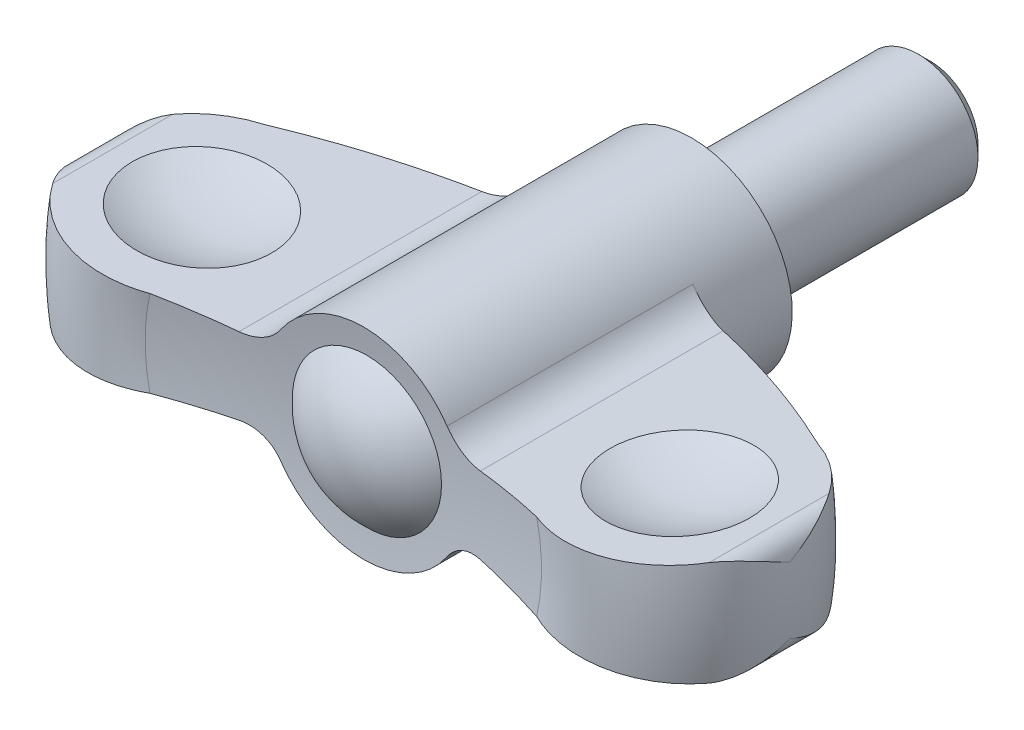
ISO-10303-21;
HEADER;
FILE_DESCRIPTION(('STEP AP214'),'2;1');
FILE_NAME('part.step','',(''),(''),'','','');
FILE_SCHEMA(('AUTOMOTIVE_DESIGN { 1 0 10303 214 1 1 1 1 }'));
ENDSEC;
DATA;
#1=APPLICATION_CONTEXT('core data for automotive mechanical design processes');
#2=APPLICATION_PROTOCOL_DEFINITION('international standard','automotive_design',2000,#1);
#3=PRODUCT_CONTEXT('',#1,'mechanical');
#4=PRODUCT('Part','Part','',(#3));
#5=PRODUCT_RELATED_PRODUCT_CATEGORY('part','',(#4));
#6=PRODUCT_DEFINITION_FORMATION('','',#4);
#7=PRODUCT_DEFINITION_CONTEXT('part definition',#1,'design');
#8=PRODUCT_DEFINITION('design','',#6,#7);
#9=PRODUCT_DEFINITION_SHAPE('','',#8);
#10=(LENGTH_UNIT() NAMED_UNIT(*) SI_UNIT(.MILLI.,.METRE.));
#11=(NAMED_UNIT(*) PLANE_ANGLE_UNIT() SI_UNIT($,.RADIAN.));
#12=(NAMED_UNIT(*) SI_UNIT($,.STERADIAN.) SOLID_ANGLE_UNIT());
#13=UNCERTAINTY_MEASURE_WITH_UNIT(LENGTH_MEASURE(1.E-05),#10,'distance_accuracy_value','');
#14=(GEOMETRIC_REPRESENTATION_CONTEXT(3) GLOBAL_UNCERTAINTY_ASSIGNED_CONTEXT((#13)) GLOBAL_UNIT_ASSIGNED_CONTEXT((#10,
#11,#12)) REPRESENTATION_CONTEXT('',''));
#15=CARTESIAN_POINT('',(0.,0.,0.));
#16=DIRECTION('',(0.,0.,1.));
#17=DIRECTION('',(1.,0.,0.));
#18=AXIS2_PLACEMENT_3D('',#15,#16,#17);
#19=CARTESIAN_POINT('',(0.,0.,60.8916836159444));
#20=DIRECTION('',(0.,0.,1.));
#21=DIRECTION('',(0.,1.,0.));
#22=AXIS2_PLACEMENT_3D('',#19,#20,#21);
#23=DEGENERATE_TOROIDAL_SURFACE('',#22,7.24809636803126,57.1330492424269,.F.);
#24=CARTESIAN_POINT('',(0.,0.,5.5));
#25=DIRECTION('',(0.,0.,1.));
#26=DIRECTION('',(0.,1.,0.));
#27=AXIS2_PLACEMENT_3D('',#24,#25,#26);
#28=CIRCLE('',#27,6.75);
#29=CARTESIAN_POINT('',(5.58468393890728,-3.79128016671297,5.5));
#30=VERTEX_POINT('',#29);
#31=CARTESIAN_POINT('',(5.58468393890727,3.79128016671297,5.5));
#32=VERTEX_POINT('',#31);
#33=EDGE_CURVE('E157',#30,#32,#28,.T.);
#34=ORIENTED_EDGE('',*,*,#33,.T.);
#35=CARTESIAN_POINT('',(5.58454817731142,3.79148016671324,5.5000000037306));
#36=CARTESIAN_POINT('',(5.6270350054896,3.72886637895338,5.49999203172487));
#37=CARTESIAN_POINT('',(5.67207292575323,3.66799067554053,5.50109190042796));
#38=CARTESIAN_POINT('',(5.76687239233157,3.55013742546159,5.50546469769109));
#39=CARTESIAN_POINT('',(5.81663303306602,3.49315913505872,5.5087372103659));
#40=CARTESIAN_POINT('',(5.92037232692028,3.3836500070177,5.51740071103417));
#41=CARTESIAN_POINT('',(5.97433893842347,3.33110730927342,5.5227858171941));
#42=CARTESIAN_POINT('',(6.08617319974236,3.23065312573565,5.53558959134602));
#43=CARTESIAN_POINT('',(6.14404090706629,3.1827417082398,5.54300828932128));
#44=CARTESIAN_POINT('',(6.32281948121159,3.04645743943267,5.56816484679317));
#45=CARTESIAN_POINT('',(6.44903201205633,2.9654018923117,5.58881397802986));
#46=CARTESIAN_POINT('',(6.71175482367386,2.82481579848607,5.63683026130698));
#47=CARTESIAN_POINT('',(6.84827321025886,2.76530241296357,5.66420274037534));
#48=CARTESIAN_POINT('',(7.13180529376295,2.66747892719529,5.72532830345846));
#49=CARTESIAN_POINT('',(7.27900617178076,2.62981214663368,5.75923917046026));
#50=CARTESIAN_POINT('',(7.57631968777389,2.57880440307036,5.83159976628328));
#51=CARTESIAN_POINT('',(7.72642802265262,2.56542990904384,5.87004316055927));
#52=CARTESIAN_POINT('',(7.91146899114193,2.56375196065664,5.91959867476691));
#53=CARTESIAN_POINT('',(7.94691227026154,2.56410633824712,5.92918950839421));
#54=CARTESIAN_POINT('',(8.01766035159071,2.56615563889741,5.94852854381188));
#55=CARTESIAN_POINT('',(8.05296528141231,2.56784856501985,5.958276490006));
#56=CARTESIAN_POINT('',(8.08821506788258,2.57020553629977,5.96810530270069));
#57=B_SPLINE_CURVE_WITH_KNOTS('',3,(#35,#36,#37,#38,#39,#40,#41,#42,#43,#44,#45,#46,#47,#48,#49,
#50,#51,#52,#53,#54,#55,#56),.UNSPECIFIED.,.F.,.F.,(4,2,2,2,2,2,2,2,2,2,4),(0.,
0.226923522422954,0.453803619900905,0.680056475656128,0.906312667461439,1.35828167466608,
1.81060994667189,2.27565813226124,2.74006391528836,2.85020967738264,2.96019142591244),.UNSPECIFIED.);
#58=CARTESIAN_POINT('',(8.08801506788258,2.57019216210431,5.96804953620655));
#59=VERTEX_POINT('',#58);
#60=EDGE_CURVE('E251',#32,#59,#57,.T.);
#61=ORIENTED_EDGE('',*,*,#60,.T.);
#62=CARTESIAN_POINT('',(18.5568278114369,3.2698755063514,10.0639861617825));
#63=CARTESIAN_POINT('',(17.7202118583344,3.21396025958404,9.63606709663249));
#64=CARTESIAN_POINT('',(16.8730027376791,3.15733701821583,9.22898268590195));
#65=CARTESIAN_POINT('',(15.1615683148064,3.04295325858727,8.45851890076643));
#66=CARTESIAN_POINT('',(14.2973907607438,2.98519593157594,8.09503297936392));
#67=CARTESIAN_POINT('',(12.5519653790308,2.86854038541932,7.41164455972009));
#68=CARTESIAN_POINT('',(11.6707170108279,2.80964213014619,7.09174344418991));
#69=CARTESIAN_POINT('',(10.3366076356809,2.72047689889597,6.64515483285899));
#70=CARTESIAN_POINT('',(9.88928279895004,2.6905799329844,6.5016730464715));
#71=CARTESIAN_POINT('',(8.99112522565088,2.63055155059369,6.22618011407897));
#72=CARTESIAN_POINT('',(8.54029244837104,2.6004201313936,6.0941691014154));
#73=CARTESIAN_POINT('',(8.08781506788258,2.57017879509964,5.96799377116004));
#74=B_SPLINE_CURVE_WITH_KNOTS('',3,(#62,#63,#64,#65,#66,#67,#68,#69,#70,#71,#72,#73),
.UNSPECIFIED.,.F.,.F.,(4,2,2,2,2,4),(0.,2.82377208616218,5.64049635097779,8.45730995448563,
9.86934742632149,11.2814013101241),.UNSPECIFIED.);
#75=CARTESIAN_POINT('',(18.5564367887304,3.26984937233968,10.0637861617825));
#76=VERTEX_POINT('',#75);
#77=EDGE_CURVE('E242',#76,#59,#74,.T.);
#78=ORIENTED_EDGE('',*,*,#77,.F.);
#79=CARTESIAN_POINT('',(0.,0.,10.0637861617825));
#80=DIRECTION('',(0.,0.,1.));
#81=DIRECTION('',(0.,1.,0.));
#82=AXIS2_PLACEMENT_3D('',#79,#80,#81);
#83=CIRCLE('',#82,18.8423263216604);
#84=CARTESIAN_POINT('',(18.5564367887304,-3.26984937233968,10.0637861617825));
#85=VERTEX_POINT('',#84);
#86=EDGE_CURVE('E402',#85,#76,#83,.T.);
#87=ORIENTED_EDGE('',*,*,#86,.F.);
#88=CARTESIAN_POINT('',(8.08781506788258,-2.57017879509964,5.96799377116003));
#89=CARTESIAN_POINT('',(8.43648524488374,-2.59348217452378,6.06521586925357));
#90=CARTESIAN_POINT('',(8.78418982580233,-2.6167210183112,6.16591362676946));
#91=CARTESIAN_POINT('',(9.47752423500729,-2.66306003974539,6.37414417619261));
#92=CARTESIAN_POINT('',(9.82315423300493,-2.68616022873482,6.48167640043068));
#93=CARTESIAN_POINT('',(10.8568675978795,-2.7552484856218,6.81439605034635));
#94=CARTESIAN_POINT('',(11.5417095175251,-2.80101991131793,7.04968835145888));
#95=CARTESIAN_POINT('',(13.5766416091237,-2.93702464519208,7.79319141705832));
#96=CARTESIAN_POINT('',(14.9128146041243,-3.02632779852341,8.34061833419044));
#97=CARTESIAN_POINT('',(16.6182429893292,-3.14031014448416,9.11672807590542));
#98=CARTESIAN_POINT('',(17.0086949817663,-3.16640601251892,9.29983650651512));
#99=CARTESIAN_POINT('',(17.785774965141,-3.21834217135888,9.67514693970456));
#100=CARTESIAN_POINT('',(18.1723980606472,-3.24418213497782,9.86735912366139));
#101=CARTESIAN_POINT('',(18.5568278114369,-3.2698755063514,10.0639861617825));
#102=B_SPLINE_CURVE_WITH_KNOTS('',3,(#88,#89,#90,#91,#92,#93,#94,#95,#96,#97,#98,#99,#100,#101),
.UNSPECIFIED.,.F.,.F.,(4,2,2,2,2,2,4),(0.,1.0881425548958,2.17619484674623,4.35250158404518,
8.68743833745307,9.98350841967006,11.2810638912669),.UNSPECIFIED.);
#103=CARTESIAN_POINT('',(8.08801506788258,-2.57019216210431,5.96804953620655));
#104=VERTEX_POINT('',#103);
#105=EDGE_CURVE('E232',#104,#85,#102,.T.);
#106=ORIENTED_EDGE('',*,*,#105,.F.);
#107=CARTESIAN_POINT('',(8.08821506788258,-2.57020553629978,5.96810530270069));
#108=CARTESIAN_POINT('',(8.00997344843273,-2.56497338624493,5.94629000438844));
#109=CARTESIAN_POINT('',(7.9314394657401,-2.5630200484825,5.92486614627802));
#110=CARTESIAN_POINT('',(7.77422277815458,-2.56573749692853,5.88295181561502));
#111=CARTESIAN_POINT('',(7.69554004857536,-2.57040950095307,5.862461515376));
#112=CARTESIAN_POINT('',(7.45993217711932,-2.59446790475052,5.80261995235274));
#113=CARTESIAN_POINT('',(7.30348188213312,-2.62389903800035,5.7649076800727));
#114=CARTESIAN_POINT('',(6.99637317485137,-2.7094115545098,5.69535012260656));
#115=CARTESIAN_POINT('',(6.84572761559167,-2.76554877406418,5.66351732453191));
#116=CARTESIAN_POINT('',(6.55526150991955,-2.90348395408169,5.60733410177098));
#117=CARTESIAN_POINT('',(6.4154250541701,-2.98524327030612,5.58297251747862));
#118=CARTESIAN_POINT('',(6.21564820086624,-3.12665619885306,5.55280138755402));
#119=CARTESIAN_POINT('',(6.14994832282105,-3.17769981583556,5.54373343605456));
#120=CARTESIAN_POINT('',(6.0231628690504,-3.28560819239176,5.52805647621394));
#121=CARTESIAN_POINT('',(5.96207731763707,-3.34247298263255,5.5214474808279));
#122=CARTESIAN_POINT('',(5.84481263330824,-3.46187538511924,5.51078652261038));
#123=CARTESIAN_POINT('',(5.78866161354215,-3.52444182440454,5.50674848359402));
#124=CARTESIAN_POINT('',(5.68213708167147,-3.65444758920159,5.50134928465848));
#125=CARTESIAN_POINT('',(5.63176510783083,-3.72188820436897,5.49998883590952));
#126=CARTESIAN_POINT('',(5.58454817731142,-3.79148016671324,5.50000000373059));
#127=B_SPLINE_CURVE_WITH_KNOTS('',3,(#107,#108,#109,#110,#111,#112,#113,#114,#115,#116,#117,
#118,#119,#120,#121,#122,#123,#124,#125,#126),.UNSPECIFIED.,.F.,.F.,(4,2,2,2,2,2,2,2,2,4),(0.,
0.244043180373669,0.488131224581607,0.976413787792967,1.46572175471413,1.95429525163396,
2.20506346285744,2.4558329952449,2.70794934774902,2.96013265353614),.UNSPECIFIED.);
#128=EDGE_CURVE('E222',#104,#30,#127,.T.);
#129=ORIENTED_EDGE('',*,*,#128,.T.);
#130=EDGE_LOOP('',(#34,#61,#78,#87,#106,#129));
#131=FACE_BOUND('',#130,.T.);
#132=ADVANCED_FACE('F14',(#131),#23,.F.);
#133=CARTESIAN_POINT('',(0.,0.,16.8));
#134=DIRECTION('',(0.,0.,1.));
#135=DIRECTION('',(0.,1.,0.));
#136=AXIS2_PLACEMENT_3D('',#133,#134,#135);
#137=TOROIDAL_SURFACE('',#136,16.3,7.2);
#138=CARTESIAN_POINT('',(-13.4430070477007,-2.92809317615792,10.0635861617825));
#139=CARTESIAN_POINT('',(-13.250045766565,-2.91519660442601,10.1357408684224));
#140=CARTESIAN_POINT('',(-13.0601324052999,-2.90250374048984,10.216071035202));
#141=CARTESIAN_POINT('',(-12.6877100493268,-2.8776128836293,10.3924240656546));
#142=CARTESIAN_POINT('',(-12.5052008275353,-2.86541487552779,10.4884464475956));
#143=CARTESIAN_POINT('',(-12.1489194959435,-2.84160280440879,10.6955091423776));
#144=CARTESIAN_POINT('',(-11.9751456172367,-2.8299886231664,10.8065463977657));
#145=CARTESIAN_POINT('',(-11.6375334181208,-2.8074243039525,11.042874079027));
#146=CARTESIAN_POINT('',(-11.47369496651,-2.79647415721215,11.1681643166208));
#147=CARTESIAN_POINT('',(-11.1570734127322,-2.77531274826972,11.4321870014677));
#148=CARTESIAN_POINT('',(-11.0042945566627,-2.76510176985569,11.5709245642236));
#149=CARTESIAN_POINT('',(-10.7109328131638,-2.74549493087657,11.8608983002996));
#150=CARTESIAN_POINT('',(-10.570354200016,-2.73609935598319,12.0121388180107));
#151=CARTESIAN_POINT('',(-10.3025713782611,-2.7182020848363,12.3259661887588));
#152=CARTESIAN_POINT('',(-10.1753613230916,-2.70969999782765,12.4885480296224));
#153=CARTESIAN_POINT('',(-9.93523518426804,-2.69365116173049,12.8239887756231));
#154=CARTESIAN_POINT('',(-9.82231883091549,-2.68610439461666,12.9968474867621));
#155=CARTESIAN_POINT('',(-9.61240942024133,-2.67207509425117,13.3504168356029));
#156=CARTESIAN_POINT('',(-9.51531257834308,-2.6655856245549,13.5310655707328));
#157=CARTESIAN_POINT('',(-9.33694719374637,-2.6536645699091,13.8999735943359));
#158=CARTESIAN_POINT('',(-9.2556730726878,-2.64823261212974,14.0882301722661));
#159=CARTESIAN_POINT('',(-9.10959731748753,-2.63846963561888,14.4711021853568));
#160=CARTESIAN_POINT('',(-9.0447989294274,-2.63413883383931,14.6657188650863));
#161=CARTESIAN_POINT('',(-8.93227844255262,-2.62661852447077,15.0598492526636));
#162=CARTESIAN_POINT('',(-8.88455601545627,-2.62342899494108,15.2593628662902));
#163=CARTESIAN_POINT('',(-8.80746852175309,-2.61827685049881,15.6574650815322));
#164=CARTESIAN_POINT('',(-8.77773054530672,-2.6162893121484,15.8559812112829));
#165=CARTESIAN_POINT('',(-8.73529826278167,-2.6134533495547,16.2548338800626));
#166=CARTESIAN_POINT('',(-8.7226036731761,-2.61260490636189,16.4551703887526));
#167=CARTESIAN_POINT('',(-8.71437606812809,-2.61205501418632,16.8561671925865));
#168=CARTESIAN_POINT('',(-8.71884052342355,-2.61235339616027,17.0568274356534));
#169=CARTESIAN_POINT('',(-8.74488386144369,-2.61409400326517,17.4570282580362));
#170=CARTESIAN_POINT('',(-8.76646264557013,-2.6155362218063,17.6565688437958));
#171=CARTESIAN_POINT('',(-8.82608238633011,-2.6195209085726,18.0500864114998));
#172=CARTESIAN_POINT('',(-8.86387061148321,-2.62204648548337,18.2441019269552));
#173=CARTESIAN_POINT('',(-8.95554073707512,-2.62817326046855,18.6283441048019));
#174=CARTESIAN_POINT('',(-9.00942811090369,-2.63177482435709,18.8185694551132));
#175=CARTESIAN_POINT('',(-9.13281555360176,-2.64002142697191,19.1937999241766));
#176=CARTESIAN_POINT('',(-9.20231107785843,-2.64466616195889,19.3788065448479));
#177=CARTESIAN_POINT('',(-9.35638258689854,-2.6549635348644,19.742479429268));
#178=CARTESIAN_POINT('',(-9.44096421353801,-2.66061654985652,19.9211432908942));
#179=CARTESIAN_POINT('',(-9.62545322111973,-2.67294687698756,20.2726485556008));
#180=CARTESIAN_POINT('',(-9.72550696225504,-2.6796339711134,20.4454127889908));
#181=CARTESIAN_POINT('',(-9.93957002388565,-2.69394088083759,20.7821124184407));
#182=CARTESIAN_POINT('',(-10.0535844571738,-2.70156103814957,20.9460445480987));
#183=CARTESIAN_POINT('',(-10.2946584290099,-2.71767322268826,21.263898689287));
#184=CARTESIAN_POINT('',(-10.4217143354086,-2.7261650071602,21.4178234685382));
#185=CARTESIAN_POINT('',(-10.688029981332,-2.74396421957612,21.7147703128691));
#186=CARTESIAN_POINT('',(-10.8272940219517,-2.75327193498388,21.8577885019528));
#187=CARTESIAN_POINT('',(-11.1201972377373,-2.77284812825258,22.1349543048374));
#188=CARTESIAN_POINT('',(-11.2740848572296,-2.78313321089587,22.2688382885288));
#189=CARTESIAN_POINT('',(-11.5924511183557,-2.80441122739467,22.5232972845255));
#190=CARTESIAN_POINT('',(-11.7569299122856,-2.81540417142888,22.6438721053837));
#191=CARTESIAN_POINT('',(-12.0953583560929,-2.83802304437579,22.8709220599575));
#192=CARTESIAN_POINT('',(-12.2693100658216,-2.84964911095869,22.9773941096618));
#193=CARTESIAN_POINT('',(-12.6253835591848,-2.87344729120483,23.175449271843));
#194=CARTESIAN_POINT('',(-12.8075027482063,-2.88561923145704,23.2670370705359));
#195=CARTESIAN_POINT('',(-13.1810420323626,-2.9105847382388,23.4357878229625));
#196=CARTESIAN_POINT('',(-13.37255033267,-2.92338419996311,23.5127547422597));
#197=CARTESIAN_POINT('',(-13.7613485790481,-2.94936953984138,23.6502587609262));
#198=CARTESIAN_POINT('',(-13.9586384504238,-2.96255541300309,23.7107960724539));
#199=CARTESIAN_POINT('',(-14.3576152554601,-2.98922103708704,23.8149976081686));
#200=CARTESIAN_POINT('',(-14.5593023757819,-3.00270080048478,23.8586611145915));
#201=CARTESIAN_POINT('',(-14.9656299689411,-3.02985771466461,23.9287762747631));
#202=CARTESIAN_POINT('',(-15.170270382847,-3.04353486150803,23.9552282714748));
#203=CARTESIAN_POINT('',(-15.5810553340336,-3.07098968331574,23.9907056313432));
#204=CARTESIAN_POINT('',(-15.7871999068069,-3.08476736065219,23.9997305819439));
#205=CARTESIAN_POINT('',(-16.1994347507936,-3.11231908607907,24.000257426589));
#206=CARTESIAN_POINT('',(-16.4055250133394,-3.1260931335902,23.9917658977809));
#207=CARTESIAN_POINT('',(-16.816299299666,-3.15354724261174,23.9572980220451));
#208=CARTESIAN_POINT('',(-17.0209829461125,-3.16722727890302,23.9313171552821));
#209=CARTESIAN_POINT('',(-17.4273317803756,-3.19438561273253,23.8620348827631));
#210=CARTESIAN_POINT('',(-17.6289980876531,-3.20786398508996,23.8187400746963));
#211=CARTESIAN_POINT('',(-18.0267250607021,-3.23444607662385,23.7154246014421));
#212=CARTESIAN_POINT('',(-18.2228121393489,-3.24755156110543,23.6555060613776));
#213=CARTESIAN_POINT('',(-18.6091495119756,-3.27337242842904,23.5192613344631));
#214=CARTESIAN_POINT('',(-18.7994018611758,-3.28608794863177,23.4429410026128));
#215=CARTESIAN_POINT('',(-19.1728922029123,-3.31105018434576,23.2743446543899));
#216=CARTESIAN_POINT('',(-19.3561252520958,-3.32329656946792,23.1820576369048));
#217=CARTESIAN_POINT('',(-19.7140940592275,-3.34722142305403,22.9822113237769));
#218=CARTESIAN_POINT('',(-19.8888301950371,-3.35889991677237,22.8746527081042));
#219=CARTESIAN_POINT('',(-20.2275235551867,-3.38153649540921,22.6457025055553));
#220=CARTESIAN_POINT('',(-20.3915386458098,-3.39249844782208,22.5243968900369));
#221=CARTESIAN_POINT('',(-20.7087215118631,-3.41369737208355,22.2682963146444));
#222=CARTESIAN_POINT('',(-20.8618896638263,-3.42393436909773,22.133501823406));
#223=CARTESIAN_POINT('',(-21.1559703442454,-3.44358925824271,21.851664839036));
#224=CARTESIAN_POINT('',(-21.296906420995,-3.45300872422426,21.704646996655));
#225=CARTESIAN_POINT('',(-21.565777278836,-3.47097871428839,21.3992346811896));
#226=CARTESIAN_POINT('',(-21.6937203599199,-3.47952979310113,21.240847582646));
#227=CARTESIAN_POINT('',(-21.8466005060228,-3.48974754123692,21.0342564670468));
#228=CARTESIAN_POINT('',(-21.8780226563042,-3.49184764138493,20.9907857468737));
#229=CARTESIAN_POINT('',(-21.9398602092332,-3.49598055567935,20.9031903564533));
#230=CARTESIAN_POINT('',(-21.9702765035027,-3.49801342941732,20.8590663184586));
#231=CARTESIAN_POINT('',(-22.0002000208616,-3.50001336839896,20.8146028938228));
#232=B_SPLINE_CURVE_WITH_KNOTS('',3,(#138,#139,#140,#141,#142,#143,#144,#145,#146,#147,#148,
#149,#150,#151,#152,#153,#154,#155,#156,#157,#158,#159,#160,#161,#162,#163,#164,#165,#166,#167,
#168,#169,#170,#171,#172,#173,#174,#175,#176,#177,#178,#179,#180,#181,#182,#183,#184,#185,#186,
#187,#188,#189,#190,#191,#192,#193,#194,#195,#196,#197,#198,#199,#200,#201,#202,#203,#204,#205,
#206,#207,#208,#209,#210,#211,#212,#213,#214,#215,#216,#217,#218,#219,#220,#221,#222,#223,#224,
#225,#226,#227,#228,#229,#230,#231),.UNSPECIFIED.,.F.,.F.,(4,2,2,2,2,2,2,2,2,2,2,2,2,2,2,2,2,2,
2,2,2,2,2,2,2,2,2,2,2,2,2,2,2,2,2,2,2,2,2,2,2,2,2,2,2,2,4),(0.,0.619053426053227,
1.23808785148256,1.85699641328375,2.47589680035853,3.09503355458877,3.71438635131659,
4.33346714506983,4.95253625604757,5.56736438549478,6.18197536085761,6.79670733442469,
7.41142748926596,8.01292036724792,8.61440323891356,9.21579745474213,9.81718820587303,
10.4095249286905,11.0020632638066,11.5944292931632,12.1870173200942,12.7855991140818,
13.3844007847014,13.9830361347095,14.5818832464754,15.1938756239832,15.8058768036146,
16.4180115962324,17.029953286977,17.6495959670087,18.2692306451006,18.8888916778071,
19.5085403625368,20.1282037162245,20.7476344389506,21.3672253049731,21.9865802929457,
22.6022115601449,23.217623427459,23.8334610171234,24.4492711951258,25.0614231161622,
25.6735537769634,26.2844785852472,26.8950106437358,27.0560402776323,27.216923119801),.UNSPECIFIED.);
#233=CARTESIAN_POINT('',(-12.9627653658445,-2.89599621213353,23.3370956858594));
#234=VERTEX_POINT('',#233);
#235=CARTESIAN_POINT('',(-22.0000000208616,-3.5,20.8149000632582));
#236=VERTEX_POINT('',#235);
#237=EDGE_CURVE('E276',#234,#236,#232,.T.);
#238=ORIENTED_EDGE('',*,*,#237,.F.);
#239=CARTESIAN_POINT('',(0.,0.,23.3370956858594));
#240=DIRECTION('',(0.,0.,1.));
#241=DIRECTION('',(0.,1.,0.));
#242=AXIS2_PLACEMENT_3D('',#239,#240,#241);
#243=CIRCLE('',#242,13.2823220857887);
#244=CARTESIAN_POINT('',(-12.9627653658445,2.89599621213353,23.3370956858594));
#245=VERTEX_POINT('',#244);
#246=EDGE_CURVE('E210',#245,#234,#243,.T.);
#247=ORIENTED_EDGE('',*,*,#246,.F.);
#248=CARTESIAN_POINT('',(-22.0002,3.50001336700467,20.8146029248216));
#249=CARTESIAN_POINT('',(-21.8869659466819,3.49244536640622,20.9829001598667));
#250=CARTESIAN_POINT('',(-21.7665908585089,3.48440009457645,21.1463645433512));
#251=CARTESIAN_POINT('',(-21.5125154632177,3.46741895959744,21.4625195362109));
#252=CARTESIAN_POINT('',(-21.378816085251,3.45848315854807,21.6152108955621));
#253=CARTESIAN_POINT('',(-21.0991608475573,3.43979239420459,21.9086013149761));
#254=CARTESIAN_POINT('',(-20.9532163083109,3.43003818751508,22.0493112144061));
#255=CARTESIAN_POINT('',(-20.6500231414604,3.4097742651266,22.3179109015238));
#256=CARTESIAN_POINT('',(-20.4927745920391,3.399264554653,22.445800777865));
#257=CARTESIAN_POINT('',(-20.1680719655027,3.377563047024,22.6878898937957));
#258=CARTESIAN_POINT('',(-20.0006161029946,3.36637113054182,22.8020867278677));
#259=CARTESIAN_POINT('',(-19.6566594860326,3.34338278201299,23.0160136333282));
#260=CARTESIAN_POINT('',(-19.4801554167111,3.33158612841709,23.1157383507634));
#261=CARTESIAN_POINT('',(-19.1195107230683,3.3074824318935,23.299940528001));
#262=CARTESIAN_POINT('',(-18.9353740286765,3.29517565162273,23.3844257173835));
#263=CARTESIAN_POINT('',(-18.5606181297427,3.27012883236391,23.5376689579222));
#264=CARTESIAN_POINT('',(-18.369996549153,3.25738863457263,23.6064211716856));
#265=CARTESIAN_POINT('',(-17.9830362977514,3.23152613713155,23.7279050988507));
#266=CARTESIAN_POINT('',(-17.7866806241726,3.21840270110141,23.780582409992));
#267=CARTESIAN_POINT('',(-17.3901835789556,3.19190281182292,23.8692781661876));
#268=CARTESIAN_POINT('',(-17.1900408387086,3.17852626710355,23.9052904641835));
#269=CARTESIAN_POINT('',(-16.7874574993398,3.15161960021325,23.9604036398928));
#270=CARTESIAN_POINT('',(-16.5850169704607,3.13808948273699,23.9795050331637));
#271=CARTESIAN_POINT('',(-16.1792478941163,3.11096989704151,24.0006952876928));
#272=CARTESIAN_POINT('',(-15.9759193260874,3.09738042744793,24.0027837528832));
#273=CARTESIAN_POINT('',(-15.5684666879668,3.07014832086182,23.9899203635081));
#274=CARTESIAN_POINT('',(-15.364346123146,3.05650591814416,23.9748568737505));
#275=CARTESIAN_POINT('',(-14.9580777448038,3.02935296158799,23.9276425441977));
#276=CARTESIAN_POINT('',(-14.755929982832,3.01584241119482,23.8954912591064));
#277=CARTESIAN_POINT('',(-14.3550670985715,2.98905073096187,23.814360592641));
#278=CARTESIAN_POINT('',(-14.1563513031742,2.97576955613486,23.7653845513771));
#279=CARTESIAN_POINT('',(-13.7636331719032,2.94952223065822,23.6509482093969));
#280=CARTESIAN_POINT('',(-13.5696323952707,2.9365561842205,23.5854825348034));
#281=CARTESIAN_POINT('',(-13.1865164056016,2.91095061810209,23.4380671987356));
#282=CARTESIAN_POINT('',(-12.9974412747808,2.89831377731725,23.356012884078));
#283=CARTESIAN_POINT('',(-12.6268363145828,2.87354438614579,23.1762764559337));
#284=CARTESIAN_POINT('',(-12.4453065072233,2.86141183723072,23.078594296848));
#285=CARTESIAN_POINT('',(-12.0910342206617,2.83773404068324,22.8682633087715));
#286=CARTESIAN_POINT('',(-11.9182938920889,2.8261889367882,22.7556108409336));
#287=CARTESIAN_POINT('',(-11.5829402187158,2.80377556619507,22.516182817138));
#288=CARTESIAN_POINT('',(-11.4203233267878,2.79290706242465,22.3894122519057));
#289=CARTESIAN_POINT('',(-11.1059013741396,2.77189266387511,22.1222291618));
#290=CARTESIAN_POINT('',(-10.9541266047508,2.76174879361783,21.9817808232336));
#291=CARTESIAN_POINT('',(-10.6630509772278,2.74229474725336,21.6885550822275));
#292=CARTESIAN_POINT('',(-10.5237454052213,2.73298425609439,21.5357823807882));
#293=CARTESIAN_POINT('',(-10.2585504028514,2.71525994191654,21.2188580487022));
#294=CARTESIAN_POINT('',(-10.1326659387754,2.7068464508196,21.0547022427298));
#295=CARTESIAN_POINT('',(-9.89540453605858,2.69098907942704,20.7162706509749));
#296=CARTESIAN_POINT('',(-9.78402188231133,2.68354481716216,20.5419988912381));
#297=CARTESIAN_POINT('',(-9.57753567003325,2.66974430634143,20.1860989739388));
#298=CARTESIAN_POINT('',(-9.48229586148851,2.66337895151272,20.0045502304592));
#299=CARTESIAN_POINT('',(-9.30772151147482,2.65171127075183,19.6340070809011));
#300=CARTESIAN_POINT('',(-9.22838099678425,2.64640854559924,19.445015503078));
#301=CARTESIAN_POINT('',(-9.0862443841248,2.6369088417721,19.0608700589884));
#302=CARTESIAN_POINT('',(-9.02344908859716,2.63271191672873,18.8657158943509));
#303=CARTESIAN_POINT('',(-8.91497467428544,2.62546202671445,18.4706862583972));
#304=CARTESIAN_POINT('',(-8.86929523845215,2.62240904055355,18.2708108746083));
#305=CARTESIAN_POINT('',(-8.79627719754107,2.61752887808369,17.8722020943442));
#306=CARTESIAN_POINT('',(-8.76856256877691,2.61567657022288,17.6735378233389));
#307=CARTESIAN_POINT('',(-8.73017446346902,2.61311090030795,17.2745631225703));
#308=CARTESIAN_POINT('',(-8.71950071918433,2.61239752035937,17.0742527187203));
#309=CARTESIAN_POINT('',(-8.71529310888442,2.61211630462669,16.6734663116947));
#310=CARTESIAN_POINT('',(-8.72175798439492,2.61254838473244,16.4729903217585));
#311=CARTESIAN_POINT('',(-8.75176494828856,2.61455390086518,16.0733272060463));
#312=CARTESIAN_POINT('',(-8.77530694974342,2.61612733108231,15.8741400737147));
#313=CARTESIAN_POINT('',(-8.83878915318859,2.62037016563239,15.481363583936));
#314=CARTESIAN_POINT('',(-8.87848770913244,2.62302341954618,15.2877349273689));
#315=CARTESIAN_POINT('',(-8.97393104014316,2.62940237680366,14.9044232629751));
#316=CARTESIAN_POINT('',(-9.029681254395,2.6331284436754,14.7147416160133));
#317=CARTESIAN_POINT('',(-9.15673580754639,2.64162013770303,14.3407362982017));
#318=CARTESIAN_POINT('',(-9.2280365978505,2.64638552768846,14.1564114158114));
#319=CARTESIAN_POINT('',(-9.38562068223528,2.65691766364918,13.7943056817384));
#320=CARTESIAN_POINT('',(-9.47190458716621,2.66268445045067,13.6165250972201));
#321=CARTESIAN_POINT('',(-9.65980249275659,2.67524261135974,13.2667770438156));
#322=CARTESIAN_POINT('',(-9.76157423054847,2.68204452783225,13.094894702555));
#323=CARTESIAN_POINT('',(-9.97895442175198,2.69657313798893,12.7601587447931));
#324=CARTESIAN_POINT('',(-10.094562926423,2.70429983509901,12.5973051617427));
#325=CARTESIAN_POINT('',(-10.3388280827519,2.72062530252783,12.28159984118));
#326=CARTESIAN_POINT('',(-10.4674919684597,2.72922455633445,12.1287537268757));
#327=CARTESIAN_POINT('',(-10.7368892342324,2.74722972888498,11.8341521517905));
#328=CARTESIAN_POINT('',(-10.8776225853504,2.75663564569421,11.6923966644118));
#329=CARTESIAN_POINT('',(-11.1735584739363,2.77641452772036,11.4177499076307));
#330=CARTESIAN_POINT('',(-11.3290201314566,2.78680481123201,11.2851390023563));
#331=CARTESIAN_POINT('',(-11.6503816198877,2.80828301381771,11.0334204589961));
#332=CARTESIAN_POINT('',(-11.8162777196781,2.81937068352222,10.914308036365));
#333=CARTESIAN_POINT('',(-12.1571151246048,2.8421505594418,10.690516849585));
#334=CARTESIAN_POINT('',(-12.3320419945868,2.85384180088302,10.5858159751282));
#335=CARTESIAN_POINT('',(-12.6898958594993,2.87775897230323,10.3913862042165));
#336=CARTESIAN_POINT('',(-12.8728180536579,2.88998458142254,10.3016484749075));
#337=CARTESIAN_POINT('',(-13.1223586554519,2.90666263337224,10.1918600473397));
#338=CARTESIAN_POINT('',(-13.1860214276,2.9109175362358,10.1649193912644));
#339=CARTESIAN_POINT('',(-13.3140099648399,2.91947165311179,10.1128788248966));
#340=CARTESIAN_POINT('',(-13.3783349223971,2.92377081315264,10.0877769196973));
#341=CARTESIAN_POINT('',(-13.4430070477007,2.92809317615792,10.0635861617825));
#342=B_SPLINE_CURVE_WITH_KNOTS('',3,(#248,#249,#250,#251,#252,#253,#254,#255,#256,#257,#258,
#259,#260,#261,#262,#263,#264,#265,#266,#267,#268,#269,#270,#271,#272,#273,#274,#275,#276,#277,
#278,#279,#280,#281,#282,#283,#284,#285,#286,#287,#288,#289,#290,#291,#292,#293,#294,#295,#296,
#297,#298,#299,#300,#301,#302,#303,#304,#305,#306,#307,#308,#309,#310,#311,#312,#313,#314,#315,
#316,#317,#318,#319,#320,#321,#322,#323,#324,#325,#326,#327,#328,#329,#330,#331,#332,#333,#334,
#335,#336,#337,#338,#339,#340,#341),.UNSPECIFIED.,.F.,.F.,(4,2,2,2,2,2,2,2,2,2,2,2,2,2,2,2,2,2,
2,2,2,2,2,2,2,2,2,2,2,2,2,2,2,2,2,2,2,2,2,2,2,2,2,2,2,2,4),(0.,0.608767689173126,
1.21749295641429,1.82566153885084,2.43382591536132,3.04209697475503,3.65059249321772,
4.25877850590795,4.86718980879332,5.47763788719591,6.08831095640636,6.698965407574,
7.30963407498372,7.92430017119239,8.53898228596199,9.15354244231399,9.76830314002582,
10.387070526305,11.0058397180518,11.6247595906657,12.2434613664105,12.8638290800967,
13.4839612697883,14.1043221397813,14.7244377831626,15.3390262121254,15.9533833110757,
16.5677702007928,17.1821457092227,17.7832066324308,18.3842581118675,18.9852654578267,
19.5862697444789,20.1785973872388,20.7711259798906,21.3635195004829,21.9559371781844,
22.5548514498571,23.1537679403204,23.7530181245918,24.3522668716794,24.9653566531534,
25.5782284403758,26.1901492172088,26.8017074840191,27.0094652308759,27.2169941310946),.UNSPECIFIED.);
#343=CARTESIAN_POINT('',(-22.,3.5,20.8149000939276));
#344=VERTEX_POINT('',#343);
#345=EDGE_CURVE('E298',#344,#245,#342,.T.);
#346=ORIENTED_EDGE('',*,*,#345,.F.);
#347=CARTESIAN_POINT('',(-23.3936651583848,2.23303167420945,16.8));
#348=CARTESIAN_POINT('',(-23.3934426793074,2.23536251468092,16.8051493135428));
#349=CARTESIAN_POINT('',(-23.3932143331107,2.23769289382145,16.8102988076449));
#350=CARTESIAN_POINT('',(-23.3743145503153,2.42570445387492,17.2258528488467));
#351=CARTESIAN_POINT('',(-23.3183956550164,2.60830531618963,17.6373544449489));
#352=CARTESIAN_POINT('',(-23.1798743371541,2.85965877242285,18.2505518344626));
#353=CARTESIAN_POINT('',(-23.1245479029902,2.939723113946,18.4543861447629));
#354=CARTESIAN_POINT('',(-22.9956909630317,3.08909813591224,18.8603432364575));
#355=CARTESIAN_POINT('',(-22.9221687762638,3.1584137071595,19.0624667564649));
#356=CARTESIAN_POINT('',(-22.7850793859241,3.26116367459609,19.3959296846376));
#357=CARTESIAN_POINT('',(-22.7265638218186,3.29880232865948,19.5280746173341));
#358=CARTESIAN_POINT('',(-22.6018254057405,3.36602668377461,19.7906656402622));
#359=CARTESIAN_POINT('',(-22.5356088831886,3.39561893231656,19.9211130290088));
#360=CARTESIAN_POINT('',(-22.395316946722,3.44509635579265,20.180513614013));
#361=CARTESIAN_POINT('',(-22.3212053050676,3.46493421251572,20.3094566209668));
#362=CARTESIAN_POINT('',(-22.2046559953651,3.48552373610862,20.500765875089));
#363=CARTESIAN_POINT('',(-22.1648550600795,3.49085996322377,20.5642643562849));
#364=CARTESIAN_POINT('',(-22.0835651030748,3.49809816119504,20.6904076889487));
#365=CARTESIAN_POINT('',(-22.0420753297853,3.49999858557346,20.7530521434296));
#366=CARTESIAN_POINT('',(-21.9998,3.49999998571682,20.8151941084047));
#367=B_SPLINE_CURVE_WITH_KNOTS('',3,(#347,#348,#349,#350,#351,#352,#353,#354,#355,#356,#357,
#358,#359,#360,#361,#362,#363,#364,#365,#366),.UNSPECIFIED.,.F.,.F.,(4,2,2,2,2,2,2,2,2,4),(0.,
0.016970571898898,1.36944581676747,2.04642868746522,2.72310261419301,3.17077232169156,
3.61807665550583,4.06752995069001,4.29283181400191,4.51823506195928),.UNSPECIFIED.);
#368=CARTESIAN_POINT('',(-23.3936651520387,2.23303174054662,16.8));
#369=VERTEX_POINT('',#368);
#370=EDGE_CURVE('E360',#369,#344,#367,.T.);
#371=ORIENTED_EDGE('',*,*,#370,.F.);
#372=CARTESIAN_POINT('',(-21.9998,3.49999998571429,12.7848058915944));
#373=CARTESIAN_POINT('',(-22.0666741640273,3.49996244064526,12.8830879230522));
#374=CARTESIAN_POINT('',(-22.1315514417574,3.4952325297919,12.9826100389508));
#375=CARTESIAN_POINT('',(-22.2568815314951,3.47769367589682,13.1835115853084));
#376=CARTESIAN_POINT('',(-22.3173409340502,3.46489705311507,13.2848879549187));
#377=CARTESIAN_POINT('',(-22.4333648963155,3.43259083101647,13.4887461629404));
#378=CARTESIAN_POINT('',(-22.4889490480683,3.41310980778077,13.5912215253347));
#379=CARTESIAN_POINT('',(-22.5953729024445,3.3684102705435,13.7974289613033));
#380=CARTESIAN_POINT('',(-22.6462099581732,3.34318858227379,13.9011616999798));
#381=CARTESIAN_POINT('',(-22.774089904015,3.2701146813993,14.1765334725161));
#382=CARTESIAN_POINT('',(-22.8470051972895,3.21812877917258,14.3490158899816));
#383=CARTESIAN_POINT('',(-22.9794561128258,3.10414337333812,14.695745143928));
#384=CARTESIAN_POINT('',(-23.0389856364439,3.04213932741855,14.8699927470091));
#385=CARTESIAN_POINT('',(-23.1975205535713,2.84462859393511,15.3951794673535));
#386=CARTESIAN_POINT('',(-23.2763283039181,2.6977147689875,15.7482515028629));
#387=CARTESIAN_POINT('',(-23.3443046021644,2.49442989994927,16.2153989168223));
#388=CARTESIAN_POINT('',(-23.3580236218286,2.44419371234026,16.3292368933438));
#389=CARTESIAN_POINT('',(-23.3797700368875,2.34273549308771,16.5569077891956));
#390=CARTESIAN_POINT('',(-23.3878040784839,2.29151468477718,16.6707405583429));
#391=CARTESIAN_POINT('',(-23.3932143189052,2.23769296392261,16.7897010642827));
#392=CARTESIAN_POINT('',(-23.3934426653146,2.23536258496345,16.7948505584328));
#393=CARTESIAN_POINT('',(-23.3936651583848,2.23303167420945,16.8));
#394=B_SPLINE_CURVE_WITH_KNOTS('',3,(#372,#373,#374,#375,#376,#377,#378,#379,#380,#381,#382,
#383,#384,#385,#386,#387,#388,#389,#390,#391,#392,#393),.UNSPECIFIED.,.F.,.F.,(4,2,2,2,2,2,2,2,
2,2,4),(0.,0.356372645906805,0.712202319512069,1.06652937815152,1.42105283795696,
2.00316709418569,2.58554603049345,3.75135617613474,4.12686584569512,4.5019357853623,
4.51890635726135),.UNSPECIFIED.);
#395=CARTESIAN_POINT('',(-22.,3.5,12.7850999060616));
#396=VERTEX_POINT('',#395);
#397=EDGE_CURVE('E354',#396,#369,#394,.T.);
#398=ORIENTED_EDGE('',*,*,#397,.F.);
#399=CARTESIAN_POINT('',(-18.5559048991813,3.26981382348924,10.0635861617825));
#400=CARTESIAN_POINT('',(-18.7481532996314,3.28266274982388,10.1358408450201));
#401=CARTESIAN_POINT('',(-18.9373210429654,3.29530578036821,10.2163336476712));
#402=CARTESIAN_POINT('',(-19.308161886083,3.32009093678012,10.3931469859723));
#403=CARTESIAN_POINT('',(-19.4898343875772,3.332233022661,10.4894687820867));
#404=CARTESIAN_POINT('',(-19.8398224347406,3.35562448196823,10.6946430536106));
#405=CARTESIAN_POINT('',(-20.0083599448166,3.36688869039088,10.8031155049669));
#406=CARTESIAN_POINT('',(-20.3358278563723,3.38877501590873,11.0337190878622));
#407=CARTESIAN_POINT('',(-20.4947599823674,3.39939724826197,11.1558477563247));
#408=CARTESIAN_POINT('',(-20.7764213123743,3.41822208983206,11.3915935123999));
#409=CARTESIAN_POINT('',(-20.9007819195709,3.42653373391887,11.5032605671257));
#410=CARTESIAN_POINT('',(-21.141456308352,3.44261921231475,11.7349898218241));
#411=CARTESIAN_POINT('',(-21.2577703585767,3.45039306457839,11.8550517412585));
#412=CARTESIAN_POINT('',(-21.4842055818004,3.46552686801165,12.105686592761));
#413=CARTESIAN_POINT('',(-21.5941379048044,3.47287419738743,12.2364309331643));
#414=CARTESIAN_POINT('',(-21.8044661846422,3.48693149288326,12.5054420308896));
#415=CARTESIAN_POINT('',(-21.9048606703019,3.49364136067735,12.6437099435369));
#416=CARTESIAN_POINT('',(-22.0002,3.50001336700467,12.7853970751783));
#417=B_SPLINE_CURVE_WITH_KNOTS('',3,(#399,#400,#401,#402,#403,#404,#405,#406,#407,#408,#409,
#410,#411,#412,#413,#414,#415,#416),.UNSPECIFIED.,.F.,.F.,(4,2,2,2,2,2,2,2,4),(0.,
0.617158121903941,1.23436541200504,1.83590974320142,2.43734575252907,2.93898887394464,
3.44061523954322,3.95311321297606,4.46569010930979),.UNSPECIFIED.);
#418=CARTESIAN_POINT('',(-18.5564367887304,3.26984937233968,10.0637861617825));
#419=VERTEX_POINT('',#418);
#420=EDGE_CURVE('E277',#419,#396,#417,.T.);
#421=ORIENTED_EDGE('',*,*,#420,.F.);
#422=CARTESIAN_POINT('',(-18.5564367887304,-3.26984937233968,10.0637861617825));
#423=VERTEX_POINT('',#422);
#424=EDGE_CURVE('E399',#419,#423,#83,.T.);
#425=ORIENTED_EDGE('',*,*,#424,.T.);
#426=CARTESIAN_POINT('',(-22.0002000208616,-3.50001336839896,12.7853971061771));
#427=CARTESIAN_POINT('',(-21.8855721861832,-3.49235221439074,12.6150255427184));
#428=CARTESIAN_POINT('',(-21.7636225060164,-3.48420170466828,12.4496052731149));
#429=CARTESIAN_POINT('',(-21.5060663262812,-3.46698793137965,12.1298039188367));
#430=CARTESIAN_POINT('',(-21.3704594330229,-3.45792464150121,11.9754231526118));
#431=CARTESIAN_POINT('',(-21.0901761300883,-3.43919190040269,11.6826018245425));
#432=CARTESIAN_POINT('',(-20.9458162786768,-3.42954360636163,11.5438566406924));
#433=CARTESIAN_POINT('',(-20.6460984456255,-3.4095119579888,11.2788991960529));
#434=CARTESIAN_POINT('',(-20.4907422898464,-3.39912872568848,11.1526848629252));
#435=CARTESIAN_POINT('',(-20.1963110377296,-3.3794504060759,10.9331636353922));
#436=CARTESIAN_POINT('',(-20.058720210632,-3.37025451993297,10.8378487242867));
#437=CARTESIAN_POINT('',(-19.7772660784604,-3.35144352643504,10.6570247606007));
#438=CARTESIAN_POINT('',(-19.6334029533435,-3.34182843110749,10.571515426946));
#439=CARTESIAN_POINT('',(-19.3369202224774,-3.32201300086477,10.4089623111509));
#440=CARTESIAN_POINT('',(-19.1841783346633,-3.31180449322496,10.3321425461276));
#441=CARTESIAN_POINT('',(-18.8736362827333,-3.29104940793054,10.1895126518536));
#442=CARTESIAN_POINT('',(-18.7158354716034,-3.28050278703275,10.123703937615));
#443=CARTESIAN_POINT('',(-18.5559048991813,-3.26981382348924,10.0635861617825));
#444=B_SPLINE_CURVE_WITH_KNOTS('',3,(#426,#427,#428,#429,#430,#431,#432,#433,#434,#435,#436,
#437,#438,#439,#440,#441,#442,#443),.UNSPECIFIED.,.F.,.F.,(4,2,2,2,2,2,2,2,4),(0.,
0.616269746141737,1.23255726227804,1.83324114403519,2.43382551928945,2.93633271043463,
3.43882549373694,3.95222439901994,4.46568922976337),.UNSPECIFIED.);
#445=CARTESIAN_POINT('',(-22.0000000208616,-3.5,12.7850999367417));
#446=VERTEX_POINT('',#445);
#447=EDGE_CURVE('E530',#446,#423,#444,.T.);
#448=ORIENTED_EDGE('',*,*,#447,.F.);
#449=CARTESIAN_POINT('',(-23.3936651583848,-2.23303167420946,16.8));
#450=CARTESIAN_POINT('',(-23.3934426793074,-2.23536251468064,16.794850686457));
#451=CARTESIAN_POINT('',(-23.3932143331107,-2.23769289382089,16.7897011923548));
#452=CARTESIAN_POINT('',(-23.3743145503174,-2.42570445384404,16.374147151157));
#453=CARTESIAN_POINT('',(-23.3183956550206,-2.60830531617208,15.9626455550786));
#454=CARTESIAN_POINT('',(-23.1798743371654,-2.85965877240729,15.349448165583));
#455=CARTESIAN_POINT('',(-23.1245479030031,-2.93972311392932,15.1456138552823));
#456=CARTESIAN_POINT('',(-22.9956909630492,-3.0890981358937,14.739656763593));
#457=CARTESIAN_POINT('',(-22.922168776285,-3.15841370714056,14.5375332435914));
#458=CARTESIAN_POINT('',(-22.7850793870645,-3.26116367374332,14.2040703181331));
#459=CARTESIAN_POINT('',(-22.7265638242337,-3.29880232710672,14.0719253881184));
#460=CARTESIAN_POINT('',(-22.6018254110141,-3.36602668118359,13.8093343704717));
#461=CARTESIAN_POINT('',(-22.5356088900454,-3.39561892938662,13.6788869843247));
#462=CARTESIAN_POINT('',(-22.3953169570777,-3.44509635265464,13.4194864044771));
#463=CARTESIAN_POINT('',(-22.3212053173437,-3.46493420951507,13.2905434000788));
#464=CARTESIAN_POINT('',(-22.2046560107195,-3.48552373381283,13.0992341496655));
#465=CARTESIAN_POINT('',(-22.1648550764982,-3.49085996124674,13.035735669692));
#466=CARTESIAN_POINT('',(-22.083565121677,-3.49809816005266,12.9095923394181));
#467=CARTESIAN_POINT('',(-22.0420753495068,-3.49999858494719,12.8469478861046));
#468=CARTESIAN_POINT('',(-21.9998000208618,-3.4999999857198,12.784805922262));
#469=B_SPLINE_CURVE_WITH_KNOTS('',3,(#449,#450,#451,#452,#453,#454,#455,#456,#457,#458,#459,
#460,#461,#462,#463,#464,#465,#466,#467,#468),.UNSPECIFIED.,.F.,.F.,(4,2,2,2,2,2,2,2,2,4),(0.,
0.0169705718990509,1.36944581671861,2.0464286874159,2.72310261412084,3.17077231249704,
3.61807663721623,4.06752992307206,4.29283178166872,4.51823502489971),.UNSPECIFIED.);
#470=CARTESIAN_POINT('',(-23.393665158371,-2.23303167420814,16.8));
#471=VERTEX_POINT('',#470);
#472=EDGE_CURVE('E372',#471,#446,#469,.T.);
#473=ORIENTED_EDGE('',*,*,#472,.F.);
#474=CARTESIAN_POINT('',(-21.9998000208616,-3.49999998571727,20.8151940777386));
#475=CARTESIAN_POINT('',(-22.0666741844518,-3.49996243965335,20.7169120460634));
#476=CARTESIAN_POINT('',(-22.1315514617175,-3.49523252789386,20.617389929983));
#477=CARTESIAN_POINT('',(-22.2568815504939,-3.47769367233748,20.4164883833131));
#478=CARTESIAN_POINT('',(-22.3173409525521,-3.46489704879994,20.315112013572));
#479=CARTESIAN_POINT('',(-22.4333649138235,-3.43259082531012,20.111253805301));
#480=CARTESIAN_POINT('',(-22.488949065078,-3.41310980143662,20.0087784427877));
#481=CARTESIAN_POINT('',(-22.5953729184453,-3.36841026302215,19.802571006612));
#482=CARTESIAN_POINT('',(-22.6462099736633,-3.34318857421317,19.6988382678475));
#483=CARTESIAN_POINT('',(-22.7740899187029,-3.27011467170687,19.4234664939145));
#484=CARTESIAN_POINT('',(-22.8470052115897,-3.21812876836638,19.2509840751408));
#485=CARTESIAN_POINT('',(-22.9794561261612,-3.10414336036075,18.9042548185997));
#486=CARTESIAN_POINT('',(-23.0389856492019,-3.04213931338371,18.7300072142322));
#487=CARTESIAN_POINT('',(-23.1975205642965,-2.84462857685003,18.2048204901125));
#488=CARTESIAN_POINT('',(-23.2763283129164,-2.69771475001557,17.8517484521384));
#489=CARTESIAN_POINT('',(-23.3443046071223,-2.49442988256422,17.3846010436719));
#490=CARTESIAN_POINT('',(-23.3580236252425,-2.44419369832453,17.2707630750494));
#491=CARTESIAN_POINT('',(-23.379770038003,-2.34273548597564,17.0430921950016));
#492=CARTESIAN_POINT('',(-23.3878040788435,-2.29151468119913,16.9292594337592));
#493=CARTESIAN_POINT('',(-23.3932143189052,-2.23769296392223,16.8102989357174));
#494=CARTESIAN_POINT('',(-23.3934426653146,-2.23536258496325,16.8051494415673));
#495=CARTESIAN_POINT('',(-23.3936651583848,-2.23303167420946,16.8));
#496=B_SPLINE_CURVE_WITH_KNOTS('',3,(#474,#475,#476,#477,#478,#479,#480,#481,#482,#483,#484,
#485,#486,#487,#488,#489,#490,#491,#492,#493,#494,#495),.UNSPECIFIED.,.F.,.F.,(4,2,2,2,2,2,2,2,
2,2,4),(0.,0.356372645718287,0.712202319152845,1.0665293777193,1.42105283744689,
2.00316709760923,2.58554603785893,3.75135619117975,4.12686583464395,4.50193574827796,
4.51890632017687),.UNSPECIFIED.);
#497=EDGE_CURVE('E366',#236,#471,#496,.T.);
#498=ORIENTED_EDGE('',*,*,#497,.F.);
#499=EDGE_LOOP('',(#238,#247,#346,#371,#398,#421,#425,#448,#473,#498));
#500=FACE_BOUND('',#499,.T.);
#501=ADVANCED_FACE('F391',(#500),#137,.T.);
#502=CARTESIAN_POINT('',(0.,0.,0.));
#503=DIRECTION('',(0.,0.,1.));
#504=DIRECTION('',(0.,1.,0.));
#505=AXIS2_PLACEMENT_3D('',#502,#503,#504);
#506=PLANE('',#505);
#507=CARTESIAN_POINT('',(0.,0.,0.));
#508=DIRECTION('',(0.,0.,1.));
#509=DIRECTION('',(0.,1.,0.));
#510=AXIS2_PLACEMENT_3D('',#507,#508,#509);
#511=CIRCLE('',#510,4.);
#512=CARTESIAN_POINT('',(0.,4.,0.));
#513=VERTEX_POINT('',#512);
#514=EDGE_CURVE('E552',#513,#513,#511,.F.);
#515=ORIENTED_EDGE('',*,*,#514,.F.);
#516=EDGE_LOOP('',(#515));
#517=FACE_BOUND('',#516,.T.);
#518=CARTESIAN_POINT('',(0.,0.,0.));
#519=DIRECTION('',(0.,0.,1.));
#520=DIRECTION('',(0.,1.,0.));
#521=AXIS2_PLACEMENT_3D('',#518,#519,#520);
#522=CIRCLE('',#521,6.75);
#523=CARTESIAN_POINT('',(0.,6.75,0.));
#524=VERTEX_POINT('',#523);
#525=EDGE_CURVE('E146',#524,#524,#522,.T.);
#526=ORIENTED_EDGE('',*,*,#525,.F.);
#527=EDGE_LOOP('',(#526));
#528=FACE_BOUND('',#527,.T.);
#529=ADVANCED_FACE('F395',(#517,#528),#506,.F.);
#530=CARTESIAN_POINT('',(0.,0.,21.5));
#531=DIRECTION('',(0.,0.,1.));
#532=DIRECTION('',(0.,1.,0.));
#533=AXIS2_PLACEMENT_3D('',#530,#531,#532);
#534=CYLINDRICAL_SURFACE('',#533,6.75);
#535=CARTESIAN_POINT('',(-5.58468393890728,3.79128016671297,5.5));
#536=VERTEX_POINT('',#535);
#537=CARTESIAN_POINT('',(-5.58468393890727,-3.79128016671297,5.5));
#538=VERTEX_POINT('',#537);
#539=EDGE_CURVE('E398',#536,#538,#28,.T.);
#540=ORIENTED_EDGE('',*,*,#539,.F.);
#541=DIRECTION('',(0.,0.,-1.));
#542=VECTOR('',#541,1.);
#543=CARTESIAN_POINT('',(-5.58468393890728,3.79128016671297,47.));
#544=LINE('',#543,#542);
#545=CARTESIAN_POINT('',(-5.58468393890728,3.79128016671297,21.9677808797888));
#546=VERTEX_POINT('',#545);
#547=EDGE_CURVE('E447',#546,#536,#544,.T.);
#548=ORIENTED_EDGE('',*,*,#547,.F.);
#549=CARTESIAN_POINT('',(0.,0.,21.9677808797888));
#550=DIRECTION('',(0.,0.,1.));
#551=DIRECTION('',(0.,1.,0.));
#552=AXIS2_PLACEMENT_3D('',#549,#550,#551);
#553=CIRCLE('',#552,6.75);
#554=CARTESIAN_POINT('',(5.58468393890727,3.79128016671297,21.9677808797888));
#555=VERTEX_POINT('',#554);
#556=EDGE_CURVE('E516',#555,#546,#553,.T.);
#557=ORIENTED_EDGE('',*,*,#556,.F.);
#558=DIRECTION('',(0.,0.,-1.));
#559=VECTOR('',#558,1.);
#560=CARTESIAN_POINT('',(5.58468393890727,3.79128016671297,47.));
#561=LINE('',#560,#559);
#562=EDGE_CURVE('E445',#555,#32,#561,.T.);
#563=ORIENTED_EDGE('',*,*,#562,.T.);
#564=ORIENTED_EDGE('',*,*,#33,.F.);
#565=DIRECTION('',(0.,0.,-1.));
#566=VECTOR('',#565,1.);
#567=CARTESIAN_POINT('',(5.58468393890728,-3.79128016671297,47.));
#568=LINE('',#567,#566);
#569=CARTESIAN_POINT('',(5.58468393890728,-3.79128016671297,21.9677808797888));
#570=VERTEX_POINT('',#569);
#571=EDGE_CURVE('E140',#570,#30,#568,.T.);
#572=ORIENTED_EDGE('',*,*,#571,.F.);
#573=CARTESIAN_POINT('',(0.,0.,21.9677808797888));
#574=DIRECTION('',(0.,0.,1.));
#575=DIRECTION('',(0.,1.,0.));
#576=AXIS2_PLACEMENT_3D('',#573,#574,#575);
#577=CIRCLE('',#576,6.75);
#578=CARTESIAN_POINT('',(-5.58468393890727,-3.79128016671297,21.9677808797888));
#579=VERTEX_POINT('',#578);
#580=EDGE_CURVE('E153',#579,#570,#577,.T.);
#581=ORIENTED_EDGE('',*,*,#580,.F.);
#582=DIRECTION('',(0.,0.,-1.));
#583=VECTOR('',#582,1.);
#584=CARTESIAN_POINT('',(-5.58468393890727,-3.79128016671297,47.));
#585=LINE('',#584,#583);
#586=EDGE_CURVE('E433',#579,#538,#585,.T.);
#587=ORIENTED_EDGE('',*,*,#586,.T.);
#588=EDGE_LOOP('',(#540,#548,#557,#563,#564,#572,#581,#587));
#589=FACE_BOUND('',#588,.T.);
#590=ORIENTED_EDGE('',*,*,#525,.T.);
#591=EDGE_LOOP('',(#590));
#592=FACE_BOUND('',#591,.T.);
#593=ADVANCED_FACE('F150',(#589,#592),#534,.T.);
#594=CARTESIAN_POINT('',(-8.08781506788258,2.57017879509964,5.96799377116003));
#595=CARTESIAN_POINT('',(-8.43648524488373,2.59348217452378,6.06521586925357));
#596=CARTESIAN_POINT('',(-8.78418982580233,2.6167210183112,6.16591362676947));
#597=CARTESIAN_POINT('',(-9.47752423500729,2.66306003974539,6.37414417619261));
#598=CARTESIAN_POINT('',(-9.82315423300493,2.68616022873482,6.48167640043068));
#599=CARTESIAN_POINT('',(-10.8568675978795,2.7552484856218,6.81439605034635));
#600=CARTESIAN_POINT('',(-11.5417095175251,2.80101991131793,7.04968835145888));
#601=CARTESIAN_POINT('',(-13.5766416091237,2.93702464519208,7.79319141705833));
#602=CARTESIAN_POINT('',(-14.9128146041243,3.02632779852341,8.34061833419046));
#603=CARTESIAN_POINT('',(-16.6182429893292,3.14031014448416,9.11672807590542));
#604=CARTESIAN_POINT('',(-17.0086949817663,3.16640601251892,9.29983650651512));
#605=CARTESIAN_POINT('',(-17.785774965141,3.21834217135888,9.67514693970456));
#606=CARTESIAN_POINT('',(-18.1723980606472,3.24418213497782,9.86735912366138));
#607=CARTESIAN_POINT('',(-18.5568278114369,3.2698755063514,10.0639861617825));
#608=B_SPLINE_CURVE_WITH_KNOTS('',3,(#594,#595,#596,#597,#598,#599,#600,#601,#602,#603,#604,
#605,#606,#607),.UNSPECIFIED.,.F.,.F.,(4,2,2,2,2,2,4),(0.,1.0881425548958,2.17619484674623,
4.35250158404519,8.68743833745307,9.98350841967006,11.2810638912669),.UNSPECIFIED.);
#609=CARTESIAN_POINT('',(-8.08801506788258,2.57019216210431,5.96804953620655));
#610=VERTEX_POINT('',#609);
#611=EDGE_CURVE('E267',#610,#419,#608,.T.);
#612=ORIENTED_EDGE('',*,*,#611,.F.);
#613=CARTESIAN_POINT('',(-8.08821506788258,2.57020553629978,5.96810530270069));
#614=CARTESIAN_POINT('',(-8.00997344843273,2.56497338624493,5.94629000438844));
#615=CARTESIAN_POINT('',(-7.9314394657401,2.5630200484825,5.92486614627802));
#616=CARTESIAN_POINT('',(-7.77422277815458,2.56573749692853,5.88295181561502));
#617=CARTESIAN_POINT('',(-7.69554004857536,2.57040950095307,5.862461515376));
#618=CARTESIAN_POINT('',(-7.45993217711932,2.59446790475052,5.80261995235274));
#619=CARTESIAN_POINT('',(-7.30348188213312,2.62389903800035,5.7649076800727));
#620=CARTESIAN_POINT('',(-6.99637317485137,2.7094115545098,5.69535012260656));
#621=CARTESIAN_POINT('',(-6.84572761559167,2.76554877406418,5.66351732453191));
#622=CARTESIAN_POINT('',(-6.55526150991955,2.90348395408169,5.60733410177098));
#623=CARTESIAN_POINT('',(-6.4154250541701,2.98524327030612,5.58297251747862));
#624=CARTESIAN_POINT('',(-6.21564820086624,3.12665619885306,5.55280138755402));
#625=CARTESIAN_POINT('',(-6.14994832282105,3.17769981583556,5.54373343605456));
#626=CARTESIAN_POINT('',(-6.0231628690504,3.28560819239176,5.52805647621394));
#627=CARTESIAN_POINT('',(-5.96207731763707,3.34247298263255,5.5214474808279));
#628=CARTESIAN_POINT('',(-5.84481263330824,3.46187538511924,5.51078652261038));
#629=CARTESIAN_POINT('',(-5.78866161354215,3.52444182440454,5.50674848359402));
#630=CARTESIAN_POINT('',(-5.68213708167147,3.65444758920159,5.50134928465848));
#631=CARTESIAN_POINT('',(-5.63176510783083,3.72188820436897,5.49998883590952));
#632=CARTESIAN_POINT('',(-5.58454817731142,3.79148016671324,5.50000000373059));
#633=B_SPLINE_CURVE_WITH_KNOTS('',3,(#613,#614,#615,#616,#617,#618,#619,#620,#621,#622,#623,
#624,#625,#626,#627,#628,#629,#630,#631,#632),.UNSPECIFIED.,.F.,.F.,(4,2,2,2,2,2,2,2,2,4),(0.,
0.244043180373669,0.488131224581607,0.976413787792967,1.46572175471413,1.95429525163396,
2.20506346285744,2.4558329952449,2.70794934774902,2.96013265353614),.UNSPECIFIED.);
#634=EDGE_CURVE('E259',#610,#536,#633,.T.);
#635=ORIENTED_EDGE('',*,*,#634,.T.);
#636=ORIENTED_EDGE('',*,*,#539,.T.);
#637=CARTESIAN_POINT('',(-5.58454817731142,-3.79148016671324,5.50000000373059));
#638=CARTESIAN_POINT('',(-5.6270350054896,-3.72886637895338,5.49999203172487));
#639=CARTESIAN_POINT('',(-5.67207292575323,-3.66799067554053,5.50109190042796));
#640=CARTESIAN_POINT('',(-5.76687239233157,-3.55013742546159,5.5054646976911));
#641=CARTESIAN_POINT('',(-5.81663303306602,-3.49315913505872,5.5087372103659));
#642=CARTESIAN_POINT('',(-5.92037232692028,-3.3836500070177,5.51740071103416));
#643=CARTESIAN_POINT('',(-5.97433893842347,-3.33110730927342,5.52278581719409));
#644=CARTESIAN_POINT('',(-6.08617319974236,-3.23065312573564,5.53558959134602));
#645=CARTESIAN_POINT('',(-6.14404090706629,-3.1827417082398,5.54300828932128));
#646=CARTESIAN_POINT('',(-6.32281948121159,-3.04645743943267,5.56816484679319));
#647=CARTESIAN_POINT('',(-6.44903201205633,-2.96540189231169,5.58881397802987));
#648=CARTESIAN_POINT('',(-6.71175482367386,-2.82481579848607,5.63683026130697));
#649=CARTESIAN_POINT('',(-6.84827321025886,-2.76530241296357,5.66420274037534));
#650=CARTESIAN_POINT('',(-7.13180529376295,-2.66747892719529,5.72532830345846));
#651=CARTESIAN_POINT('',(-7.27900617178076,-2.62981214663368,5.75923917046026));
#652=CARTESIAN_POINT('',(-7.57631968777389,-2.57880440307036,5.83159976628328));
#653=CARTESIAN_POINT('',(-7.72642802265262,-2.56542990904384,5.87004316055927));
#654=CARTESIAN_POINT('',(-7.91146899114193,-2.56375196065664,5.91959867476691));
#655=CARTESIAN_POINT('',(-7.94691227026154,-2.56410633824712,5.92918950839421));
#656=CARTESIAN_POINT('',(-8.01766035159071,-2.56615563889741,5.94852854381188));
#657=CARTESIAN_POINT('',(-8.05296528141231,-2.56784856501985,5.958276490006));
#658=CARTESIAN_POINT('',(-8.08821506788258,-2.57020553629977,5.96810530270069));
#659=B_SPLINE_CURVE_WITH_KNOTS('',3,(#637,#638,#639,#640,#641,#642,#643,#644,#645,#646,#647,
#648,#649,#650,#651,#652,#653,#654,#655,#656,#657,#658),.UNSPECIFIED.,.F.,.F.,(4,2,2,2,2,2,2,2,
2,2,4),(0.,0.226923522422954,0.453803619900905,0.680056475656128,0.90631266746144,
1.35828167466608,1.81060994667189,2.27565813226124,2.74006391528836,2.85020967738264,
2.96019142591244),.UNSPECIFIED.);
#660=CARTESIAN_POINT('',(-8.08801506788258,-2.57019216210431,5.96804953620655));
#661=VERTEX_POINT('',#660);
#662=EDGE_CURVE('E194',#538,#661,#659,.T.);
#663=ORIENTED_EDGE('',*,*,#662,.T.);
#664=CARTESIAN_POINT('',(-18.5568278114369,-3.2698755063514,10.0639861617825));
#665=CARTESIAN_POINT('',(-17.7202118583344,-3.21396025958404,9.63606709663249));
#666=CARTESIAN_POINT('',(-16.8730027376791,-3.15733701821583,9.22898268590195));
#667=CARTESIAN_POINT('',(-15.1615683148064,-3.04295325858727,8.45851890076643));
#668=CARTESIAN_POINT('',(-14.2973907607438,-2.98519593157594,8.09503297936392));
#669=CARTESIAN_POINT('',(-12.5519653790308,-2.86854038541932,7.41164455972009));
#670=CARTESIAN_POINT('',(-11.6707170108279,-2.80964213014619,7.09174344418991));
#671=CARTESIAN_POINT('',(-10.3366076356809,-2.72047689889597,6.64515483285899));
#672=CARTESIAN_POINT('',(-9.88928279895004,-2.6905799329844,6.50167304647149));
#673=CARTESIAN_POINT('',(-8.99112522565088,-2.63055155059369,6.22618011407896));
#674=CARTESIAN_POINT('',(-8.54029244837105,-2.6004201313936,6.09416910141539));
#675=CARTESIAN_POINT('',(-8.08781506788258,-2.57017879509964,5.96799377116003));
#676=B_SPLINE_CURVE_WITH_KNOTS('',3,(#664,#665,#666,#667,#668,#669,#670,#671,#672,#673,#674,
#675),.UNSPECIFIED.,.F.,.F.,(4,2,2,2,2,4),(0.,2.82377208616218,5.6404963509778,8.45730995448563,
9.8693474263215,11.2814013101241),.UNSPECIFIED.);
#677=EDGE_CURVE('E204',#423,#661,#676,.T.);
#678=ORIENTED_EDGE('',*,*,#677,.F.);
#679=ORIENTED_EDGE('',*,*,#424,.F.);
#680=EDGE_LOOP('',(#612,#635,#636,#663,#678,#679));
#681=FACE_BOUND('',#680,.T.);
#682=ADVANCED_FACE('F212',(#681),#23,.F.);
#683=CARTESIAN_POINT('',(13.4430070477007,2.92809317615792,10.0635861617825));
#684=CARTESIAN_POINT('',(13.2500457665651,2.91519660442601,10.1357408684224));
#685=CARTESIAN_POINT('',(13.0601324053,2.90250374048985,10.216071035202));
#686=CARTESIAN_POINT('',(12.6877100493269,2.8776128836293,10.3924240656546));
#687=CARTESIAN_POINT('',(12.5052008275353,2.86541487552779,10.4884464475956));
#688=CARTESIAN_POINT('',(12.1489194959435,2.8416028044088,10.6955091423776));
#689=CARTESIAN_POINT('',(11.9751456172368,2.8299886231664,10.8065463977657));
#690=CARTESIAN_POINT('',(11.6375334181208,2.8074243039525,11.042874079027));
#691=CARTESIAN_POINT('',(11.4736949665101,2.79647415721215,11.1681643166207));
#692=CARTESIAN_POINT('',(11.1570734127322,2.77531274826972,11.4321870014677));
#693=CARTESIAN_POINT('',(11.0042945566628,2.7651017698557,11.5709245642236));
#694=CARTESIAN_POINT('',(10.7109328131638,2.74549493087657,11.8608983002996));
#695=CARTESIAN_POINT('',(10.570354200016,2.73609935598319,12.0121388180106));
#696=CARTESIAN_POINT('',(10.3025713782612,2.7182020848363,12.3259661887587));
#697=CARTESIAN_POINT('',(10.1753613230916,2.70969999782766,12.4885480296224));
#698=CARTESIAN_POINT('',(9.93523518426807,2.69365116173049,12.823988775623));
#699=CARTESIAN_POINT('',(9.82231883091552,2.68610439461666,12.996847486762));
#700=CARTESIAN_POINT('',(9.61240942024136,2.67207509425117,13.3504168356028));
#701=CARTESIAN_POINT('',(9.51531257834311,2.6655856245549,13.5310655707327));
#702=CARTESIAN_POINT('',(9.3369471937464,2.6536645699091,13.8999735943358));
#703=CARTESIAN_POINT('',(9.25567307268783,2.64823261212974,14.0882301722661));
#704=CARTESIAN_POINT('',(9.10959731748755,2.63846963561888,14.4711021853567));
#705=CARTESIAN_POINT('',(9.04479892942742,2.63413883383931,14.6657188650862));
#706=CARTESIAN_POINT('',(8.93227844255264,2.62661852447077,15.0598492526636));
#707=CARTESIAN_POINT('',(8.88455601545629,2.62342899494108,15.2593628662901));
#708=CARTESIAN_POINT('',(8.80746852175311,2.61827685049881,15.6574650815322));
#709=CARTESIAN_POINT('',(8.77773054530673,2.6162893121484,15.8559812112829));
#710=CARTESIAN_POINT('',(8.73529826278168,2.6134533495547,16.2548338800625));
#711=CARTESIAN_POINT('',(8.7226036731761,2.61260490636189,16.4551703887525));
#712=CARTESIAN_POINT('',(8.71437606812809,2.61205501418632,16.8561671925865));
#713=CARTESIAN_POINT('',(8.71884052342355,2.61235339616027,17.0568274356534));
#714=CARTESIAN_POINT('',(8.74488386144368,2.61409400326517,17.4570282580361));
#715=CARTESIAN_POINT('',(8.76646264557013,2.6155362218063,17.6565688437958));
#716=CARTESIAN_POINT('',(8.82608238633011,2.6195209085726,18.0500864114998));
#717=CARTESIAN_POINT('',(8.8638706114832,2.62204648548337,18.2441019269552));
#718=CARTESIAN_POINT('',(8.95554073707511,2.62817326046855,18.6283441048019));
#719=CARTESIAN_POINT('',(9.00942811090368,2.63177482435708,18.8185694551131));
#720=CARTESIAN_POINT('',(9.13281555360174,2.64002142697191,19.1937999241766));
#721=CARTESIAN_POINT('',(9.20231107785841,2.64466616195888,19.3788065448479));
#722=CARTESIAN_POINT('',(9.35638258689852,2.6549635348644,19.742479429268));
#723=CARTESIAN_POINT('',(9.44096421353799,2.66061654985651,19.9211432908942));
#724=CARTESIAN_POINT('',(9.6254532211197,2.67294687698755,20.2726485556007));
#725=CARTESIAN_POINT('',(9.72550696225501,2.6796339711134,20.4454127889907));
#726=CARTESIAN_POINT('',(9.93957002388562,2.69394088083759,20.7821124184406));
#727=CARTESIAN_POINT('',(10.0535844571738,2.70156103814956,20.9460445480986));
#728=CARTESIAN_POINT('',(10.2946584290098,2.71767322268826,21.2638986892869));
#729=CARTESIAN_POINT('',(10.4217143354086,2.7261650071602,21.4178234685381));
#730=CARTESIAN_POINT('',(10.688029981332,2.74396421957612,21.7147703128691));
#731=CARTESIAN_POINT('',(10.8272940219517,2.75327193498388,21.8577885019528));
#732=CARTESIAN_POINT('',(11.1201972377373,2.77284812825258,22.1349543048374));
#733=CARTESIAN_POINT('',(11.2740848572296,2.78313321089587,22.2688382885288));
#734=CARTESIAN_POINT('',(11.5924511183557,2.80441122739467,22.5232972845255));
#735=CARTESIAN_POINT('',(11.7569299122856,2.81540417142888,22.6438721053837));
#736=CARTESIAN_POINT('',(12.0953583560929,2.83802304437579,22.8709220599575));
#737=CARTESIAN_POINT('',(12.2693100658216,2.84964911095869,22.9773941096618));
#738=CARTESIAN_POINT('',(12.6253835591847,2.87344729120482,23.175449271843));
#739=CARTESIAN_POINT('',(12.8075027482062,2.88561923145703,23.2670370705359));
#740=CARTESIAN_POINT('',(13.1810420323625,2.91058473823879,23.4357878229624));
#741=CARTESIAN_POINT('',(13.3725503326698,2.92338419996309,23.5127547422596));
#742=CARTESIAN_POINT('',(13.7613485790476,2.94936953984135,23.650258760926));
#743=CARTESIAN_POINT('',(13.9586384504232,2.96255541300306,23.7107960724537));
#744=CARTESIAN_POINT('',(14.3576152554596,2.989221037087,23.8149976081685));
#745=CARTESIAN_POINT('',(14.5593023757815,3.00270080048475,23.8586611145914));
#746=CARTESIAN_POINT('',(14.9656299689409,3.0298577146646,23.928776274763));
#747=CARTESIAN_POINT('',(15.1702703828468,3.04353486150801,23.9552282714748));
#748=CARTESIAN_POINT('',(15.5810553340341,3.07098968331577,23.9907056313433));
#749=CARTESIAN_POINT('',(15.7871999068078,3.08476736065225,23.999730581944));
#750=CARTESIAN_POINT('',(16.1994347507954,3.11231908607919,24.000257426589));
#751=CARTESIAN_POINT('',(16.4055250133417,3.12609313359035,23.9917658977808));
#752=CARTESIAN_POINT('',(16.8162992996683,3.15354724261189,23.9572980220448));
#753=CARTESIAN_POINT('',(17.0209829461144,3.16722727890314,23.9313171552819));
#754=CARTESIAN_POINT('',(17.4273317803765,3.19438561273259,23.8620348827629));
#755=CARTESIAN_POINT('',(17.6289980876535,3.20786398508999,23.8187400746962));
#756=CARTESIAN_POINT('',(18.0267250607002,3.23444607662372,23.7154246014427));
#757=CARTESIAN_POINT('',(18.2228121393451,3.24755156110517,23.6555060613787));
#758=CARTESIAN_POINT('',(18.6091495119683,3.27337242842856,23.5192613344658));
#759=CARTESIAN_POINT('',(18.7994018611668,3.28608794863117,23.4429410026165));
#760=CARTESIAN_POINT('',(19.1728922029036,3.31105018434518,23.2743446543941));
#761=CARTESIAN_POINT('',(19.3561252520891,3.32329656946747,23.1820576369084));
#762=CARTESIAN_POINT('',(19.7140940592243,3.34722142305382,22.9822113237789));
#763=CARTESIAN_POINT('',(19.8888301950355,3.35889991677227,22.8746527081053));
#764=CARTESIAN_POINT('',(20.2275235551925,3.3815364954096,22.6457025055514));
#765=CARTESIAN_POINT('',(20.3915386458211,3.39249844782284,22.5243968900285));
#766=CARTESIAN_POINT('',(20.7087215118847,3.41369737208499,22.2682963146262));
#767=CARTESIAN_POINT('',(20.8618896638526,3.42393436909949,22.1335018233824));
#768=CARTESIAN_POINT('',(21.1559703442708,3.44358925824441,21.85166483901));
#769=CARTESIAN_POINT('',(21.2969064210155,3.45300872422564,21.7046469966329));
#770=CARTESIAN_POINT('',(21.5657772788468,3.4709787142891,21.3992346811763));
#771=CARTESIAN_POINT('',(21.693720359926,3.47952979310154,21.2408475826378));
#772=CARTESIAN_POINT('',(21.8466005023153,3.48974754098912,21.0342564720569));
#773=CARTESIAN_POINT('',(21.8780226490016,3.49184764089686,20.9907857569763));
#774=CARTESIAN_POINT('',(21.9398601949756,3.49598055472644,20.9031903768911));
#775=CARTESIAN_POINT('',(21.9702764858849,3.49801342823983,20.8590663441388));
#776=CARTESIAN_POINT('',(22.0002,3.50001336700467,20.8146029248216));
#777=B_SPLINE_CURVE_WITH_KNOTS('',3,(#683,#684,#685,#686,#687,#688,#689,#690,#691,#692,#693,
#694,#695,#696,#697,#698,#699,#700,#701,#702,#703,#704,#705,#706,#707,#708,#709,#710,#711,#712,
#713,#714,#715,#716,#717,#718,#719,#720,#721,#722,#723,#724,#725,#726,#727,#728,#729,#730,#731,
#732,#733,#734,#735,#736,#737,#738,#739,#740,#741,#742,#743,#744,#745,#746,#747,#748,#749,#750,
#751,#752,#753,#754,#755,#756,#757,#758,#759,#760,#761,#762,#763,#764,#765,#766,#767,#768,#769,
#770,#771,#772,#773,#774,#775,#776),.UNSPECIFIED.,.F.,.F.,(4,2,2,2,2,2,2,2,2,2,2,2,2,2,2,2,2,2,
2,2,2,2,2,2,2,2,2,2,2,2,2,2,2,2,2,2,2,2,2,2,2,2,2,2,2,2,4),(0.,0.619053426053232,
1.23808785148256,1.85699641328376,2.47589680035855,3.09503355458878,3.7143863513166,
4.33346714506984,4.95253625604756,5.56736438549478,6.18197536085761,6.7967073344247,
7.41142748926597,8.01292036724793,8.61440323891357,9.21579745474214,9.81718820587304,
10.4095249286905,11.0020632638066,11.5944292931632,12.1870173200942,12.7855991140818,
13.3844007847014,13.9830361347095,14.5818832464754,15.1938756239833,15.8058768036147,
16.4180115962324,17.029953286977,17.6495959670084,18.2692306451,18.8888916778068,
19.5085403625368,20.128203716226,20.7476344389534,21.3672253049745,21.9865802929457,
22.6022115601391,23.2176234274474,23.8334610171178,24.4492711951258,25.0614231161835,
25.6735537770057,26.2844785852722,26.8950106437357,27.0560402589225,27.2169230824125),.UNSPECIFIED.);
#778=CARTESIAN_POINT('',(12.9627653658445,2.89599621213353,23.3370956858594));
#779=VERTEX_POINT('',#778);
#780=CARTESIAN_POINT('',(22.,3.5,20.8149000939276));
#781=VERTEX_POINT('',#780);
#782=EDGE_CURVE('E314',#779,#781,#777,.T.);
#783=ORIENTED_EDGE('',*,*,#782,.F.);
#784=CARTESIAN_POINT('',(12.9627653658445,-2.89599621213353,23.3370956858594));
#785=VERTEX_POINT('',#784);
#786=EDGE_CURVE('E203',#785,#779,#243,.T.);
#787=ORIENTED_EDGE('',*,*,#786,.F.);
#788=CARTESIAN_POINT('',(22.0002,-3.50001336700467,20.8146029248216));
#789=CARTESIAN_POINT('',(21.8869659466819,-3.49244536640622,20.9829001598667));
#790=CARTESIAN_POINT('',(21.7665908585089,-3.48440009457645,21.1463645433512));
#791=CARTESIAN_POINT('',(21.5125154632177,-3.46741895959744,21.4625195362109));
#792=CARTESIAN_POINT('',(21.378816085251,-3.45848315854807,21.6152108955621));
#793=CARTESIAN_POINT('',(21.0991608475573,-3.43979239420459,21.9086013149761));
#794=CARTESIAN_POINT('',(20.9532163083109,-3.43003818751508,22.0493112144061));
#795=CARTESIAN_POINT('',(20.6500231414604,-3.4097742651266,22.3179109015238));
#796=CARTESIAN_POINT('',(20.4927745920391,-3.399264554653,22.445800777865));
#797=CARTESIAN_POINT('',(20.1680719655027,-3.377563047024,22.6878898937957));
#798=CARTESIAN_POINT('',(20.0006161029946,-3.36637113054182,22.8020867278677));
#799=CARTESIAN_POINT('',(19.6566594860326,-3.34338278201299,23.0160136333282));
#800=CARTESIAN_POINT('',(19.4801554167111,-3.33158612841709,23.1157383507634));
#801=CARTESIAN_POINT('',(19.1195107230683,-3.3074824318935,23.299940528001));
#802=CARTESIAN_POINT('',(18.9353740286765,-3.29517565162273,23.3844257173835));
#803=CARTESIAN_POINT('',(18.5606181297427,-3.27012883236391,23.5376689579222));
#804=CARTESIAN_POINT('',(18.369996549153,-3.25738863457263,23.6064211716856));
#805=CARTESIAN_POINT('',(17.9830362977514,-3.23152613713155,23.7279050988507));
#806=CARTESIAN_POINT('',(17.7866806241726,-3.21840270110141,23.780582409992));
#807=CARTESIAN_POINT('',(17.3901835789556,-3.19190281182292,23.8692781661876));
#808=CARTESIAN_POINT('',(17.1900408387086,-3.17852626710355,23.9052904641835));
#809=CARTESIAN_POINT('',(16.7874574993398,-3.15161960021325,23.9604036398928));
#810=CARTESIAN_POINT('',(16.5850169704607,-3.13808948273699,23.9795050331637));
#811=CARTESIAN_POINT('',(16.1792478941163,-3.11096989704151,24.0006952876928));
#812=CARTESIAN_POINT('',(15.9759193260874,-3.09738042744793,24.0027837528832));
#813=CARTESIAN_POINT('',(15.5684666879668,-3.07014832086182,23.9899203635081));
#814=CARTESIAN_POINT('',(15.364346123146,-3.05650591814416,23.9748568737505));
#815=CARTESIAN_POINT('',(14.9580777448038,-3.02935296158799,23.9276425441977));
#816=CARTESIAN_POINT('',(14.755929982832,-3.01584241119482,23.8954912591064));
#817=CARTESIAN_POINT('',(14.3550670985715,-2.98905073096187,23.814360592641));
#818=CARTESIAN_POINT('',(14.1563513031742,-2.97576955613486,23.7653845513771));
#819=CARTESIAN_POINT('',(13.7636331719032,-2.94952223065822,23.6509482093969));
#820=CARTESIAN_POINT('',(13.5696323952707,-2.9365561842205,23.5854825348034));
#821=CARTESIAN_POINT('',(13.1865164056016,-2.91095061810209,23.4380671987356));
#822=CARTESIAN_POINT('',(12.9974412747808,-2.89831377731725,23.356012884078));
#823=CARTESIAN_POINT('',(12.6268363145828,-2.87354438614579,23.1762764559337));
#824=CARTESIAN_POINT('',(12.4453065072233,-2.86141183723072,23.078594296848));
#825=CARTESIAN_POINT('',(12.0910342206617,-2.83773404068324,22.8682633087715));
#826=CARTESIAN_POINT('',(11.9182938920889,-2.8261889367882,22.7556108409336));
#827=CARTESIAN_POINT('',(11.5829402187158,-2.80377556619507,22.516182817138));
#828=CARTESIAN_POINT('',(11.4203233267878,-2.79290706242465,22.3894122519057));
#829=CARTESIAN_POINT('',(11.1059013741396,-2.77189266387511,22.1222291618));
#830=CARTESIAN_POINT('',(10.9541266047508,-2.76174879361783,21.9817808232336));
#831=CARTESIAN_POINT('',(10.6630509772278,-2.74229474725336,21.6885550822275));
#832=CARTESIAN_POINT('',(10.5237454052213,-2.73298425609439,21.5357823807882));
#833=CARTESIAN_POINT('',(10.2585504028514,-2.71525994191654,21.2188580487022));
#834=CARTESIAN_POINT('',(10.1326659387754,-2.7068464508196,21.0547022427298));
#835=CARTESIAN_POINT('',(9.89540453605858,-2.69098907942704,20.7162706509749));
#836=CARTESIAN_POINT('',(9.78402188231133,-2.68354481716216,20.5419988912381));
#837=CARTESIAN_POINT('',(9.57753567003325,-2.66974430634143,20.1860989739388));
#838=CARTESIAN_POINT('',(9.48229586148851,-2.66337895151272,20.0045502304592));
#839=CARTESIAN_POINT('',(9.30772151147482,-2.65171127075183,19.6340070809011));
#840=CARTESIAN_POINT('',(9.22838099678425,-2.64640854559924,19.445015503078));
#841=CARTESIAN_POINT('',(9.0862443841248,-2.6369088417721,19.0608700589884));
#842=CARTESIAN_POINT('',(9.02344908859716,-2.63271191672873,18.8657158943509));
#843=CARTESIAN_POINT('',(8.91497467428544,-2.62546202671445,18.4706862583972));
#844=CARTESIAN_POINT('',(8.86929523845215,-2.62240904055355,18.2708108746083));
#845=CARTESIAN_POINT('',(8.79627719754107,-2.61752887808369,17.8722020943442));
#846=CARTESIAN_POINT('',(8.76856256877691,-2.61567657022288,17.6735378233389));
#847=CARTESIAN_POINT('',(8.73017446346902,-2.61311090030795,17.2745631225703));
#848=CARTESIAN_POINT('',(8.71950071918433,-2.61239752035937,17.0742527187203));
#849=CARTESIAN_POINT('',(8.71529310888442,-2.61211630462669,16.6734663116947));
#850=CARTESIAN_POINT('',(8.72175798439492,-2.61254838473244,16.4729903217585));
#851=CARTESIAN_POINT('',(8.75176494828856,-2.61455390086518,16.0733272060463));
#852=CARTESIAN_POINT('',(8.77530694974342,-2.61612733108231,15.8741400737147));
#853=CARTESIAN_POINT('',(8.83878915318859,-2.62037016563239,15.481363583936));
#854=CARTESIAN_POINT('',(8.87848770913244,-2.62302341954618,15.2877349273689));
#855=CARTESIAN_POINT('',(8.97393104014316,-2.62940237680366,14.9044232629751));
#856=CARTESIAN_POINT('',(9.029681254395,-2.6331284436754,14.7147416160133));
#857=CARTESIAN_POINT('',(9.15673580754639,-2.64162013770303,14.3407362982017));
#858=CARTESIAN_POINT('',(9.2280365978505,-2.64638552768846,14.1564114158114));
#859=CARTESIAN_POINT('',(9.38562068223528,-2.65691766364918,13.7943056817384));
#860=CARTESIAN_POINT('',(9.47190458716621,-2.66268445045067,13.6165250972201));
#861=CARTESIAN_POINT('',(9.65980249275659,-2.67524261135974,13.2667770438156));
#862=CARTESIAN_POINT('',(9.76157423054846,-2.68204452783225,13.094894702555));
#863=CARTESIAN_POINT('',(9.97895442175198,-2.69657313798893,12.7601587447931));
#864=CARTESIAN_POINT('',(10.094562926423,-2.70429983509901,12.5973051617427));
#865=CARTESIAN_POINT('',(10.3388280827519,-2.72062530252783,12.28159984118));
#866=CARTESIAN_POINT('',(10.4674919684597,-2.72922455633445,12.1287537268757));
#867=CARTESIAN_POINT('',(10.7368892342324,-2.74722972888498,11.8341521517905));
#868=CARTESIAN_POINT('',(10.8776225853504,-2.75663564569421,11.6923966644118));
#869=CARTESIAN_POINT('',(11.1735584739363,-2.77641452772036,11.4177499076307));
#870=CARTESIAN_POINT('',(11.3290201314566,-2.78680481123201,11.2851390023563));
#871=CARTESIAN_POINT('',(11.6503816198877,-2.80828301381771,11.0334204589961));
#872=CARTESIAN_POINT('',(11.8162777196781,-2.81937068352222,10.914308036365));
#873=CARTESIAN_POINT('',(12.1571151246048,-2.8421505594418,10.690516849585));
#874=CARTESIAN_POINT('',(12.3320419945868,-2.85384180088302,10.5858159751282));
#875=CARTESIAN_POINT('',(12.6898958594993,-2.87775897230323,10.3913862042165));
#876=CARTESIAN_POINT('',(12.8728180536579,-2.88998458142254,10.3016484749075));
#877=CARTESIAN_POINT('',(13.1223586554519,-2.90666263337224,10.1918600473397));
#878=CARTESIAN_POINT('',(13.1860214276,-2.9109175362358,10.1649193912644));
#879=CARTESIAN_POINT('',(13.31400996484,-2.9194716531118,10.1128788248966));
#880=CARTESIAN_POINT('',(13.3783349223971,-2.92377081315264,10.0877769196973));
#881=CARTESIAN_POINT('',(13.4430070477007,-2.92809317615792,10.0635861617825));
#882=B_SPLINE_CURVE_WITH_KNOTS('',3,(#788,#789,#790,#791,#792,#793,#794,#795,#796,#797,#798,
#799,#800,#801,#802,#803,#804,#805,#806,#807,#808,#809,#810,#811,#812,#813,#814,#815,#816,#817,
#818,#819,#820,#821,#822,#823,#824,#825,#826,#827,#828,#829,#830,#831,#832,#833,#834,#835,#836,
#837,#838,#839,#840,#841,#842,#843,#844,#845,#846,#847,#848,#849,#850,#851,#852,#853,#854,#855,
#856,#857,#858,#859,#860,#861,#862,#863,#864,#865,#866,#867,#868,#869,#870,#871,#872,#873,#874,
#875,#876,#877,#878,#879,#880,#881),.UNSPECIFIED.,.F.,.F.,(4,2,2,2,2,2,2,2,2,2,2,2,2,2,2,2,2,2,
2,2,2,2,2,2,2,2,2,2,2,2,2,2,2,2,2,2,2,2,2,2,2,2,2,2,2,2,4),(0.,0.608767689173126,
1.21749295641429,1.82566153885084,2.43382591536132,3.04209697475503,3.65059249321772,
4.25877850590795,4.86718980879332,5.47763788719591,6.08831095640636,6.698965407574,
7.30963407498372,7.92430017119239,8.53898228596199,9.15354244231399,9.76830314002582,
10.387070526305,11.0058397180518,11.6247595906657,12.2434613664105,12.8638290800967,
13.4839612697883,14.1043221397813,14.7244377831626,15.3390262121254,15.9533833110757,
16.5677702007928,17.1821457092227,17.7832066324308,18.3842581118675,18.9852654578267,
19.5862697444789,20.1785973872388,20.7711259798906,21.3635195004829,21.9559371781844,
22.5548514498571,23.1537679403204,23.7530181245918,24.3522668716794,24.9653566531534,
25.5782284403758,26.1901492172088,26.8017074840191,27.0094652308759,27.2169941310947),.UNSPECIFIED.);
#883=CARTESIAN_POINT('',(22.,-3.5,20.8149000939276));
#884=VERTEX_POINT('',#883);
#885=EDGE_CURVE('E418',#884,#785,#882,.T.);
#886=ORIENTED_EDGE('',*,*,#885,.F.);
#887=CARTESIAN_POINT('',(23.3936651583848,-2.23303167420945,16.8));
#888=CARTESIAN_POINT('',(23.3934426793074,-2.23536251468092,16.8051493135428));
#889=CARTESIAN_POINT('',(23.3932143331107,-2.23769289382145,16.8102988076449));
#890=CARTESIAN_POINT('',(23.3743145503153,-2.42570445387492,17.2258528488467));
#891=CARTESIAN_POINT('',(23.3183956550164,-2.60830531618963,17.6373544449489));
#892=CARTESIAN_POINT('',(23.1798743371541,-2.85965877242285,18.2505518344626));
#893=CARTESIAN_POINT('',(23.1245479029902,-2.939723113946,18.4543861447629));
#894=CARTESIAN_POINT('',(22.9956909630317,-3.08909813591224,18.8603432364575));
#895=CARTESIAN_POINT('',(22.9221687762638,-3.1584137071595,19.0624667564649));
#896=CARTESIAN_POINT('',(22.7850793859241,-3.26116367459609,19.3959296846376));
#897=CARTESIAN_POINT('',(22.7265638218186,-3.29880232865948,19.5280746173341));
#898=CARTESIAN_POINT('',(22.6018254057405,-3.36602668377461,19.7906656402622));
#899=CARTESIAN_POINT('',(22.5356088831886,-3.39561893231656,19.9211130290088));
#900=CARTESIAN_POINT('',(22.395316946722,-3.44509635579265,20.180513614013));
#901=CARTESIAN_POINT('',(22.3212053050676,-3.46493421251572,20.3094566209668));
#902=CARTESIAN_POINT('',(22.2046559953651,-3.48552373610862,20.500765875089));
#903=CARTESIAN_POINT('',(22.1648550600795,-3.49085996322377,20.5642643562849));
#904=CARTESIAN_POINT('',(22.0835651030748,-3.49809816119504,20.6904076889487));
#905=CARTESIAN_POINT('',(22.0420753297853,-3.49999858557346,20.7530521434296));
#906=CARTESIAN_POINT('',(21.9998,-3.49999998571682,20.8151941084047));
#907=B_SPLINE_CURVE_WITH_KNOTS('',3,(#887,#888,#889,#890,#891,#892,#893,#894,#895,#896,#897,
#898,#899,#900,#901,#902,#903,#904,#905,#906),.UNSPECIFIED.,.F.,.F.,(4,2,2,2,2,2,2,2,2,4),(0.,
0.016970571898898,1.36944581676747,2.04642868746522,2.72310261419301,3.17077232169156,
3.61807665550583,4.06752995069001,4.29283181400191,4.51823506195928),.UNSPECIFIED.);
#908=CARTESIAN_POINT('',(23.3936651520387,-2.23303174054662,16.8));
#909=VERTEX_POINT('',#908);
#910=EDGE_CURVE('E497',#909,#884,#907,.T.);
#911=ORIENTED_EDGE('',*,*,#910,.F.);
#912=CARTESIAN_POINT('',(21.9998,-3.49999998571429,12.7848058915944));
#913=CARTESIAN_POINT('',(22.0666741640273,-3.49996244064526,12.8830879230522));
#914=CARTESIAN_POINT('',(22.1315514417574,-3.4952325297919,12.9826100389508));
#915=CARTESIAN_POINT('',(22.2568815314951,-3.47769367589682,13.1835115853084));
#916=CARTESIAN_POINT('',(22.3173409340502,-3.46489705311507,13.2848879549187));
#917=CARTESIAN_POINT('',(22.4333648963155,-3.43259083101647,13.4887461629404));
#918=CARTESIAN_POINT('',(22.4889490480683,-3.41310980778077,13.5912215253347));
#919=CARTESIAN_POINT('',(22.5953729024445,-3.3684102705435,13.7974289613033));
#920=CARTESIAN_POINT('',(22.6462099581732,-3.34318858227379,13.9011616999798));
#921=CARTESIAN_POINT('',(22.774089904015,-3.2701146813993,14.1765334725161));
#922=CARTESIAN_POINT('',(22.8470051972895,-3.21812877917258,14.3490158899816));
#923=CARTESIAN_POINT('',(22.9794561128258,-3.10414337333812,14.695745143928));
#924=CARTESIAN_POINT('',(23.0389856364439,-3.04213932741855,14.8699927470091));
#925=CARTESIAN_POINT('',(23.1975205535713,-2.84462859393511,15.3951794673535));
#926=CARTESIAN_POINT('',(23.2763283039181,-2.6977147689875,15.7482515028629));
#927=CARTESIAN_POINT('',(23.3443046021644,-2.49442989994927,16.2153989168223));
#928=CARTESIAN_POINT('',(23.3580236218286,-2.44419371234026,16.3292368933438));
#929=CARTESIAN_POINT('',(23.3797700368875,-2.34273549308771,16.5569077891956));
#930=CARTESIAN_POINT('',(23.3878040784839,-2.29151468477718,16.6707405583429));
#931=CARTESIAN_POINT('',(23.3932143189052,-2.23769296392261,16.7897010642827));
#932=CARTESIAN_POINT('',(23.3934426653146,-2.23536258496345,16.7948505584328));
#933=CARTESIAN_POINT('',(23.3936651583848,-2.23303167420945,16.8));
#934=B_SPLINE_CURVE_WITH_KNOTS('',3,(#912,#913,#914,#915,#916,#917,#918,#919,#920,#921,#922,
#923,#924,#925,#926,#927,#928,#929,#930,#931,#932,#933),.UNSPECIFIED.,.F.,.F.,(4,2,2,2,2,2,2,2,
2,2,4),(0.,0.356372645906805,0.712202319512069,1.06652937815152,1.42105283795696,
2.00316709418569,2.58554603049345,3.75135617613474,4.12686584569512,4.5019357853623,
4.51890635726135),.UNSPECIFIED.);
#935=CARTESIAN_POINT('',(22.,-3.5,12.7850999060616));
#936=VERTEX_POINT('',#935);
#937=EDGE_CURVE('E496',#936,#909,#934,.T.);
#938=ORIENTED_EDGE('',*,*,#937,.F.);
#939=CARTESIAN_POINT('',(18.5559048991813,-3.26981382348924,10.0635861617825));
#940=CARTESIAN_POINT('',(18.7481532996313,-3.28266274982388,10.1358408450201));
#941=CARTESIAN_POINT('',(18.9373210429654,-3.29530578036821,10.2163336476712));
#942=CARTESIAN_POINT('',(19.3081618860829,-3.32009093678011,10.3931469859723));
#943=CARTESIAN_POINT('',(19.4898343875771,-3.332233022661,10.4894687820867));
#944=CARTESIAN_POINT('',(19.8398224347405,-3.35562448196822,10.6946430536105));
#945=CARTESIAN_POINT('',(20.0083599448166,-3.36688869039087,10.8031155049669));
#946=CARTESIAN_POINT('',(20.3358278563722,-3.38877501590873,11.0337190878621));
#947=CARTESIAN_POINT('',(20.4947599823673,-3.39939724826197,11.1558477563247));
#948=CARTESIAN_POINT('',(20.7764213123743,-3.41822208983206,11.3915935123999));
#949=CARTESIAN_POINT('',(20.9007819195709,-3.42653373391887,11.5032605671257));
#950=CARTESIAN_POINT('',(21.1414563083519,-3.44261921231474,11.734989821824));
#951=CARTESIAN_POINT('',(21.2577703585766,-3.45039306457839,11.8550517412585));
#952=CARTESIAN_POINT('',(21.4842055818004,-3.46552686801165,12.1056865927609));
#953=CARTESIAN_POINT('',(21.5941379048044,-3.47287419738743,12.2364309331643));
#954=CARTESIAN_POINT('',(21.8044661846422,-3.48693149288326,12.5054420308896));
#955=CARTESIAN_POINT('',(21.9048606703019,-3.49364136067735,12.6437099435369));
#956=CARTESIAN_POINT('',(22.0002,-3.50001336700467,12.7853970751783));
#957=B_SPLINE_CURVE_WITH_KNOTS('',3,(#939,#940,#941,#942,#943,#944,#945,#946,#947,#948,#949,
#950,#951,#952,#953,#954,#955,#956),.UNSPECIFIED.,.F.,.F.,(4,2,2,2,2,2,2,2,4),(0.,
0.617158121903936,1.23436541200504,1.83590974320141,2.43734575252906,2.93898887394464,
3.44061523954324,3.9531132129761,4.46569010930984),.UNSPECIFIED.);
#958=EDGE_CURVE('E423',#85,#936,#957,.T.);
#959=ORIENTED_EDGE('',*,*,#958,.F.);
#960=ORIENTED_EDGE('',*,*,#86,.T.);
#961=CARTESIAN_POINT('',(22.0002,3.50001336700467,12.7853970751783));
#962=CARTESIAN_POINT('',(21.8855721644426,3.4923522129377,12.6150255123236));
#963=CARTESIAN_POINT('',(21.7636224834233,3.48420170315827,12.4496052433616));
#964=CARTESIAN_POINT('',(21.5060663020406,3.46698792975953,12.129803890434));
#965=CARTESIAN_POINT('',(21.3704594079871,3.45792463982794,11.9754231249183));
#966=CARTESIAN_POINT('',(21.0901761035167,3.43919189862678,11.6826017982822));
#967=CARTESIAN_POINT('',(20.9458162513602,3.42954360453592,11.5438566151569));
#968=CARTESIAN_POINT('',(20.6460984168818,3.40951195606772,11.2788991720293));
#969=CARTESIAN_POINT('',(20.4907422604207,3.39912872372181,11.1526848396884));
#970=CARTESIAN_POINT('',(20.1963110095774,3.37945040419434,10.9331636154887));
#971=CARTESIAN_POINT('',(20.058720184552,3.37025451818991,10.837848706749));
#972=CARTESIAN_POINT('',(19.7772660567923,3.35144352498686,10.657024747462));
#973=CARTESIAN_POINT('',(19.6334029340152,3.34182842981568,10.5715154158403));
#974=CARTESIAN_POINT('',(19.3369202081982,3.32201299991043,10.4089623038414));
#975=CARTESIAN_POINT('',(19.1841783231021,3.31180449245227,10.3321425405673));
#976=CARTESIAN_POINT('',(18.8736362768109,3.29104940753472,10.1895126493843));
#977=CARTESIAN_POINT('',(18.7158354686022,3.28050278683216,10.1237039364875));
#978=CARTESIAN_POINT('',(18.5559048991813,3.26981382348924,10.0635861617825));
#979=B_SPLINE_CURVE_WITH_KNOTS('',3,(#961,#962,#963,#964,#965,#966,#967,#968,#969,#970,#971,
#972,#973,#974,#975,#976,#977,#978),.UNSPECIFIED.,.F.,.F.,(4,2,2,2,2,2,2,2,4),(0.,
0.616269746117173,1.23255726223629,1.83324114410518,2.43382551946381,2.93633270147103,
3.43882547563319,3.95222437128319,4.46568919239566),.UNSPECIFIED.);
#980=CARTESIAN_POINT('',(22.,3.5,12.7850999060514));
#981=VERTEX_POINT('',#980);
#982=EDGE_CURVE('E313',#981,#76,#979,.T.);
#983=ORIENTED_EDGE('',*,*,#982,.F.);
#984=CARTESIAN_POINT('',(23.3936651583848,2.23303167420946,16.8));
#985=CARTESIAN_POINT('',(23.3934426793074,2.23536251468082,16.7948506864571));
#986=CARTESIAN_POINT('',(23.3932143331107,2.23769289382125,16.7897011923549));
#987=CARTESIAN_POINT('',(23.3743145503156,2.42570445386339,16.3741471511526));
#988=CARTESIAN_POINT('',(23.3183956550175,2.60830531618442,15.9626455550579));
#989=CARTESIAN_POINT('',(23.1798743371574,2.85965877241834,15.3494481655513));
#990=CARTESIAN_POINT('',(23.1245479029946,2.93972311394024,15.1456138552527));
#991=CARTESIAN_POINT('',(22.9956909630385,3.08909813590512,14.7396567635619));
#992=CARTESIAN_POINT('',(22.9221687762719,3.15841370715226,14.5375332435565));
#993=CARTESIAN_POINT('',(22.7850793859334,3.26116367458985,14.2040703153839));
#994=CARTESIAN_POINT('',(22.7265638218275,3.29880232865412,14.0719253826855));
#995=CARTESIAN_POINT('',(22.6018254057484,3.36602668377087,13.8093343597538));
#996=CARTESIAN_POINT('',(22.5356088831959,3.39561893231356,13.6788869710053));
#997=CARTESIAN_POINT('',(22.3953169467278,3.44509635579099,13.4194863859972));
#998=CARTESIAN_POINT('',(22.3212053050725,3.46493421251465,13.2905433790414));
#999=CARTESIAN_POINT('',(22.2046559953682,3.48552373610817,13.099234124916));
#1000=CARTESIAN_POINT('',(22.164855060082,3.49085996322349,13.0357356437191));
#1001=CARTESIAN_POINT('',(22.0835651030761,3.49809816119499,12.9095923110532));
#1002=CARTESIAN_POINT('',(22.042075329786,3.49999858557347,12.8469478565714));
#1003=CARTESIAN_POINT('',(21.9998,3.49999998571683,12.7848058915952));
#1004=B_SPLINE_CURVE_WITH_KNOTS('',3,(#984,#985,#986,#987,#988,#989,#990,#991,#992,#993,#994,
#995,#996,#997,#998,#999,#1000,#1001,#1002,#1003),.UNSPECIFIED.,.F.,.F.,(4,2,2,2,2,2,2,2,2,4),
(0.,0.0169705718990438,1.36944581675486,2.04642868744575,2.72310261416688,3.17077232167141,
3.6180766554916,4.06752995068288,4.29283181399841,4.51823506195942),.UNSPECIFIED.);
#1005=CARTESIAN_POINT('',(23.393665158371,2.23303167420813,16.8));
#1006=VERTEX_POINT('',#1005);
#1007=EDGE_CURVE('E348',#1006,#981,#1004,.T.);
#1008=ORIENTED_EDGE('',*,*,#1007,.F.);
#1009=CARTESIAN_POINT('',(21.9998,3.49999998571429,20.8151941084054));
#1010=CARTESIAN_POINT('',(22.0666741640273,3.49996244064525,20.7169120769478));
#1011=CARTESIAN_POINT('',(22.1315514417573,3.49523252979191,20.6173899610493));
#1012=CARTESIAN_POINT('',(22.2568815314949,3.47769367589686,20.416488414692));
#1013=CARTESIAN_POINT('',(22.3173409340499,3.46489705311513,20.3151120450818));
#1014=CARTESIAN_POINT('',(22.4333648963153,3.43259083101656,20.1112538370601));
#1015=CARTESIAN_POINT('',(22.4889490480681,3.41310980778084,20.0087784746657));
#1016=CARTESIAN_POINT('',(22.5953729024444,3.36841027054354,19.8025710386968));
#1017=CARTESIAN_POINT('',(22.6462099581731,3.34318858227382,19.6988383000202));
#1018=CARTESIAN_POINT('',(22.774089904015,3.27011468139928,19.4234665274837));
#1019=CARTESIAN_POINT('',(22.8470051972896,3.21812877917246,19.2509841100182));
#1020=CARTESIAN_POINT('',(22.979456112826,3.10414337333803,18.9042548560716));
#1021=CARTESIAN_POINT('',(23.038985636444,3.0421393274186,18.7300072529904));
#1022=CARTESIAN_POINT('',(23.1975205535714,2.84462859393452,18.2048205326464));
#1023=CARTESIAN_POINT('',(23.2763283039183,2.69771476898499,17.851748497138));
#1024=CARTESIAN_POINT('',(23.3443046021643,2.49442989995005,17.3846010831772));
#1025=CARTESIAN_POINT('',(23.3580236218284,2.44419371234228,17.2707631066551));
#1026=CARTESIAN_POINT('',(23.3797700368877,2.34273549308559,17.0430922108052));
#1027=CARTESIAN_POINT('',(23.3878040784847,2.29151468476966,16.9292594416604));
#1028=CARTESIAN_POINT('',(23.3932143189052,2.23769296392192,16.8102989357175));
#1029=CARTESIAN_POINT('',(23.3934426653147,2.2353625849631,16.8051494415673));
#1030=CARTESIAN_POINT('',(23.3936651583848,2.23303167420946,16.8));
#1031=B_SPLINE_CURVE_WITH_KNOTS('',3,(#1009,#1010,#1011,#1012,#1013,#1014,#1015,#1016,#1017,
#1018,#1019,#1020,#1021,#1022,#1023,#1024,#1025,#1026,#1027,#1028,#1029,#1030),.UNSPECIFIED.,
.F.,.F.,(4,2,2,2,2,2,2,2,2,2,4),(0.,0.356372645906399,0.712202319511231,1.06652937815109,
1.42105283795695,2.00316709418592,2.58554603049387,3.7513561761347,4.1268658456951,
4.50193578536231,4.51890635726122),.UNSPECIFIED.);
#1032=EDGE_CURVE('E341',#781,#1006,#1031,.T.);
#1033=ORIENTED_EDGE('',*,*,#1032,.F.);
#1034=EDGE_LOOP('',(#783,#787,#886,#911,#938,#959,#960,#983,#1008,#1033));
#1035=FACE_BOUND('',#1034,.T.);
#1036=ADVANCED_FACE('F216',(#1035),#137,.T.);
#1037=CARTESIAN_POINT('',(0.,0.,70.4345769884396));
#1038=DIRECTION('',(0.,0.,1.));
#1039=DIRECTION('',(-1.,0.,0.));
#1040=AXIS2_PLACEMENT_3D('',#1037,#1038,#1039);
#1041=SPHERICAL_SURFACE('',#1040,48.9345769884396);
#1042=CARTESIAN_POINT('',(0.,0.,21.756113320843));
#1043=DIRECTION('',(0.,0.,1.));
#1044=DIRECTION('',(0.,1.,0.));
#1045=AXIS2_PLACEMENT_3D('',#1042,#1043,#1044);
#1046=CIRCLE('',#1045,5.);
#1047=CARTESIAN_POINT('',(0.,5.,21.756113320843));
#1048=VERTEX_POINT('',#1047);
#1049=EDGE_CURVE('E469',#1048,#1048,#1046,.T.);
#1050=ORIENTED_EDGE('',*,*,#1049,.F.);
#1051=EDGE_LOOP('',(#1050));
#1052=FACE_BOUND('',#1051,.T.);
#1053=CARTESIAN_POINT('',(0.135047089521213,2.02060361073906,70.4345769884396));
#1054=DIRECTION('',(-0.066686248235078,-0.99777399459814,0.));
#1055=DIRECTION('',(0.99777399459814,-0.066686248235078,0.));
#1056=AXIS2_PLACEMENT_3D('',#1053,#1054,#1055);
#1057=CIRCLE('',#1056,48.892655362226);
#1058=CARTESIAN_POINT('',(-8.08801506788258,2.57019216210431,22.24151784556));
#1059=VERTEX_POINT('',#1058);
#1060=EDGE_CURVE('E498',#1059,#245,#1057,.F.);
#1061=ORIENTED_EDGE('',*,*,#1060,.T.);
#1062=ORIENTED_EDGE('',*,*,#246,.T.);
#1063=CARTESIAN_POINT('',(0.135047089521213,-2.02060361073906,70.4345769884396));
#1064=DIRECTION('',(-0.066686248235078,0.99777399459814,0.));
#1065=DIRECTION('',(-0.99777399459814,-0.066686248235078,0.));
#1066=AXIS2_PLACEMENT_3D('',#1063,#1064,#1065);
#1067=CIRCLE('',#1066,48.892655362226);
#1068=CARTESIAN_POINT('',(-8.08801506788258,-2.57019216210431,22.24151784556));
#1069=VERTEX_POINT('',#1068);
#1070=EDGE_CURVE('E166',#234,#1069,#1067,.F.);
#1071=ORIENTED_EDGE('',*,*,#1070,.T.);
#1072=CARTESIAN_POINT('',(-5.5845481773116,-3.79148016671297,21.9677808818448));
#1073=CARTESIAN_POINT('',(-5.62817089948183,-3.72719562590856,21.9677779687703));
#1074=CARTESIAN_POINT('',(-5.67448035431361,-3.66473952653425,21.9684153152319));
#1075=CARTESIAN_POINT('',(-5.7721071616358,-3.54390832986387,21.970958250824));
#1076=CARTESIAN_POINT('',(-5.82342409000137,-3.48553288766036,21.972863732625));
#1077=CARTESIAN_POINT('',(-5.93061850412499,-3.37336951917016,21.9779264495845));
#1078=CARTESIAN_POINT('',(-5.98648825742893,-3.31957411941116,21.9810815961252));
#1079=CARTESIAN_POINT('',(-6.10242874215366,-3.21684674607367,21.988616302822));
#1080=CARTESIAN_POINT('',(-6.16249944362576,-3.16791473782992,21.99299585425));
#1081=CARTESIAN_POINT('',(-6.34840735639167,-3.02891495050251,22.0079292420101));
#1082=CARTESIAN_POINT('',(-6.48001546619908,-2.94656504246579,22.0202813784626));
#1083=CARTESIAN_POINT('',(-6.7546200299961,-2.80484640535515,22.0494046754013));
#1084=CARTESIAN_POINT('',(-6.89762288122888,-2.7454906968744,22.0661783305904));
#1085=CARTESIAN_POINT('',(-7.19227537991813,-2.65075858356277,22.1038207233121));
#1086=CARTESIAN_POINT('',(-7.34399100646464,-2.61560173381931,22.1247247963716));
#1087=CARTESIAN_POINT('',(-7.65042182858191,-2.57094036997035,22.169905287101));
#1088=CARTESIAN_POINT('',(-7.8051305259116,-2.561385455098,22.1941749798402));
#1089=CARTESIAN_POINT('',(-8.00225445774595,-2.56544480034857,22.2269305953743));
#1090=CARTESIAN_POINT('',(-8.04528623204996,-2.56732764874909,22.2341935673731));
#1091=CARTESIAN_POINT('',(-8.08821506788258,-2.57020553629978,22.2415521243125));
#1092=B_SPLINE_CURVE_WITH_KNOTS('',3,(#1072,#1073,#1074,#1075,#1076,#1077,#1078,#1079,#1080,
#1081,#1082,#1083,#1084,#1085,#1086,#1087,#1088,#1089,#1090,#1091),.UNSPECIFIED.,.F.,.F.,(4,2,2,
2,2,2,2,2,2,4),(0.,0.232987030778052,0.465954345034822,0.698533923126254,0.931111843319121,
1.39594600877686,1.8610430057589,2.33030607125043,2.79864464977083,2.92963638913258),.UNSPECIFIED.);
#1093=EDGE_CURVE('E164',#579,#1069,#1092,.T.);
#1094=ORIENTED_EDGE('',*,*,#1093,.F.);
#1095=ORIENTED_EDGE('',*,*,#580,.T.);
#1096=CARTESIAN_POINT('',(8.08821506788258,-2.57020553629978,22.2415521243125));
#1097=CARTESIAN_POINT('',(8.01001676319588,-2.56496633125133,22.2281482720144));
#1098=CARTESIAN_POINT('',(7.93154268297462,-2.56302102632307,22.2150714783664));
#1099=CARTESIAN_POINT('',(7.77458483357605,-2.5657284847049,22.1896601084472));
#1100=CARTESIAN_POINT('',(7.69610106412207,-2.57038154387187,22.1773255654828));
#1101=CARTESIAN_POINT('',(7.53974339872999,-2.58628928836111,22.1534987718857));
#1102=CARTESIAN_POINT('',(7.46186901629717,-2.59753801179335,22.1420057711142));
#1103=CARTESIAN_POINT('',(7.30723954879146,-2.62657090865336,22.1199361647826));
#1104=CARTESIAN_POINT('',(7.23048442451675,-2.64435485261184,22.1093595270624));
#1105=CARTESIAN_POINT('',(7.00252393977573,-2.70744959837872,22.0790970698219));
#1106=CARTESIAN_POINT('',(6.8536935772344,-2.7624961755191,22.0608893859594));
#1107=CARTESIAN_POINT('',(6.56712160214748,-2.89717209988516,22.0290252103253));
#1108=CARTESIAN_POINT('',(6.42937658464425,-2.97679386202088,22.0153673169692));
#1109=CARTESIAN_POINT('',(6.22962160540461,-3.11612516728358,21.9982096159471));
#1110=CARTESIAN_POINT('',(6.16212795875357,-3.16793025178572,21.9929370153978));
#1111=CARTESIAN_POINT('',(6.03205217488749,-3.27753600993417,21.983857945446));
#1112=CARTESIAN_POINT('',(5.96947044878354,-3.33533718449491,21.9800515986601));
#1113=CARTESIAN_POINT('',(5.84959657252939,-3.45664864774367,21.9739338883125));
#1114=CARTESIAN_POINT('',(5.79232340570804,-3.52017793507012,21.9716277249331));
#1115=CARTESIAN_POINT('',(5.68379710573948,-3.65222582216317,21.9685492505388));
#1116=CARTESIAN_POINT('',(5.63254432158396,-3.72074471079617,21.9677770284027));
#1117=CARTESIAN_POINT('',(5.58454817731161,-3.79148016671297,21.9677808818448));
#1118=B_SPLINE_CURVE_WITH_KNOTS('',3,(#1096,#1097,#1098,#1099,#1100,#1101,#1102,#1103,#1104,
#1105,#1106,#1107,#1108,#1109,#1110,#1111,#1112,#1113,#1114,#1115,#1116,#1117),.UNSPECIFIED.,
.F.,.F.,(4,2,2,2,2,2,2,2,2,2,4),(0.,0.238463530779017,0.476937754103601,0.715196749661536,
0.953447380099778,1.43015973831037,1.90672510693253,2.1621510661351,2.41759838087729,
2.67392651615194,2.9302695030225),.UNSPECIFIED.);
#1119=CARTESIAN_POINT('',(8.08801506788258,-2.57019216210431,22.24151784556));
#1120=VERTEX_POINT('',#1119);
#1121=EDGE_CURVE('E137',#1120,#570,#1118,.T.);
#1122=ORIENTED_EDGE('',*,*,#1121,.F.);
#1123=CARTESIAN_POINT('',(-0.135047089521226,-2.02060361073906,70.4345769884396));
#1124=DIRECTION('',(0.066686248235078,0.99777399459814,0.));
#1125=DIRECTION('',(-0.99777399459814,0.066686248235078,0.));
#1126=AXIS2_PLACEMENT_3D('',#1123,#1124,#1125);
#1127=CIRCLE('',#1126,48.892655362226);
#1128=EDGE_CURVE('E145',#1120,#785,#1127,.F.);
#1129=ORIENTED_EDGE('',*,*,#1128,.T.);
#1130=ORIENTED_EDGE('',*,*,#786,.T.);
#1131=CARTESIAN_POINT('',(-0.135047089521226,2.02060361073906,70.4345769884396));
#1132=DIRECTION('',(0.066686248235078,-0.99777399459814,0.));
#1133=DIRECTION('',(0.99777399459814,0.066686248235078,0.));
#1134=AXIS2_PLACEMENT_3D('',#1131,#1132,#1133);
#1135=CIRCLE('',#1134,48.892655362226);
#1136=CARTESIAN_POINT('',(8.08801506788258,2.57019216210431,22.24151784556));
#1137=VERTEX_POINT('',#1136);
#1138=EDGE_CURVE('E490',#779,#1137,#1135,.F.);
#1139=ORIENTED_EDGE('',*,*,#1138,.T.);
#1140=CARTESIAN_POINT('',(5.5845481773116,3.79148016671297,21.9677808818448));
#1141=CARTESIAN_POINT('',(5.62817089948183,3.72719562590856,21.9677779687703));
#1142=CARTESIAN_POINT('',(5.67448035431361,3.66473952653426,21.9684153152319));
#1143=CARTESIAN_POINT('',(5.7721071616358,3.54390832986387,21.970958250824));
#1144=CARTESIAN_POINT('',(5.82342409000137,3.48553288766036,21.972863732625));
#1145=CARTESIAN_POINT('',(5.93061850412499,3.37336951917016,21.9779264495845));
#1146=CARTESIAN_POINT('',(5.98648825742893,3.31957411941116,21.9810815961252));
#1147=CARTESIAN_POINT('',(6.10242874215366,3.21684674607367,21.988616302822));
#1148=CARTESIAN_POINT('',(6.16249944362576,3.16791473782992,21.99299585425));
#1149=CARTESIAN_POINT('',(6.34840735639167,3.02891495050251,22.0079292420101));
#1150=CARTESIAN_POINT('',(6.48001546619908,2.94656504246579,22.0202813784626));
#1151=CARTESIAN_POINT('',(6.7546200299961,2.80484640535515,22.0494046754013));
#1152=CARTESIAN_POINT('',(6.89762288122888,2.7454906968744,22.0661783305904));
#1153=CARTESIAN_POINT('',(7.19227537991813,2.65075858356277,22.1038207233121));
#1154=CARTESIAN_POINT('',(7.34399100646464,2.61560173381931,22.1247247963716));
#1155=CARTESIAN_POINT('',(7.65042182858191,2.57094036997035,22.169905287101));
#1156=CARTESIAN_POINT('',(7.8051305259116,2.561385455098,22.1941749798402));
#1157=CARTESIAN_POINT('',(8.00225445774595,2.56544480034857,22.2269305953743));
#1158=CARTESIAN_POINT('',(8.04528623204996,2.56732764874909,22.2341935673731));
#1159=CARTESIAN_POINT('',(8.08821506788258,2.57020553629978,22.2415521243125));
#1160=B_SPLINE_CURVE_WITH_KNOTS('',3,(#1140,#1141,#1142,#1143,#1144,#1145,#1146,#1147,#1148,
#1149,#1150,#1151,#1152,#1153,#1154,#1155,#1156,#1157,#1158,#1159),.UNSPECIFIED.,.F.,.F.,(4,2,2,
2,2,2,2,2,2,4),(0.,0.232987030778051,0.465954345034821,0.698533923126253,0.931111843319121,
1.39594600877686,1.8610430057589,2.33030607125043,2.79864464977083,2.92963638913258),.UNSPECIFIED.);
#1161=EDGE_CURVE('E519',#555,#1137,#1160,.T.);
#1162=ORIENTED_EDGE('',*,*,#1161,.F.);
#1163=ORIENTED_EDGE('',*,*,#556,.T.);
#1164=CARTESIAN_POINT('',(-8.08821506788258,2.57020553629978,22.2415521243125));
#1165=CARTESIAN_POINT('',(-8.01001676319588,2.56496633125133,22.2281482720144));
#1166=CARTESIAN_POINT('',(-7.93154268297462,2.56302102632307,22.2150714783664));
#1167=CARTESIAN_POINT('',(-7.77458483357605,2.5657284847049,22.1896601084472));
#1168=CARTESIAN_POINT('',(-7.69610106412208,2.57038154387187,22.1773255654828));
#1169=CARTESIAN_POINT('',(-7.53974339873,2.58628928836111,22.1534987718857));
#1170=CARTESIAN_POINT('',(-7.46186901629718,2.59753801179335,22.1420057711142));
#1171=CARTESIAN_POINT('',(-7.30723954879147,2.62657090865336,22.1199361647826));
#1172=CARTESIAN_POINT('',(-7.23048442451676,2.64435485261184,22.1093595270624));
#1173=CARTESIAN_POINT('',(-7.00252393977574,2.70744959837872,22.0790970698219));
#1174=CARTESIAN_POINT('',(-6.8536935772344,2.7624961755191,22.0608893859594));
#1175=CARTESIAN_POINT('',(-6.56712160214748,2.89717209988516,22.0290252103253));
#1176=CARTESIAN_POINT('',(-6.42937658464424,2.97679386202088,22.0153673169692));
#1177=CARTESIAN_POINT('',(-6.2296216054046,3.11612516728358,21.9982096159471));
#1178=CARTESIAN_POINT('',(-6.16212795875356,3.16793025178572,21.9929370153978));
#1179=CARTESIAN_POINT('',(-6.03205217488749,3.27753600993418,21.983857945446));
#1180=CARTESIAN_POINT('',(-5.96947044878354,3.33533718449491,21.9800515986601));
#1181=CARTESIAN_POINT('',(-5.84959657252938,3.45664864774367,21.9739338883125));
#1182=CARTESIAN_POINT('',(-5.79232340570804,3.52017793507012,21.9716277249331));
#1183=CARTESIAN_POINT('',(-5.68379710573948,3.65222582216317,21.9685492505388));
#1184=CARTESIAN_POINT('',(-5.63254432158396,3.72074471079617,21.9677770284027));
#1185=CARTESIAN_POINT('',(-5.58454817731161,3.79148016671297,21.9677808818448));
#1186=B_SPLINE_CURVE_WITH_KNOTS('',3,(#1164,#1165,#1166,#1167,#1168,#1169,#1170,#1171,#1172,
#1173,#1174,#1175,#1176,#1177,#1178,#1179,#1180,#1181,#1182,#1183,#1184,#1185),.UNSPECIFIED.,
.F.,.F.,(4,2,2,2,2,2,2,2,2,2,4),(0.,0.238463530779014,0.476937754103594,0.715196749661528,
0.953447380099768,1.43015973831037,1.90672510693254,2.1621510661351,2.4175983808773,
2.67392651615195,2.9302695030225),.UNSPECIFIED.);
#1187=EDGE_CURVE('E500',#1059,#546,#1186,.T.);
#1188=ORIENTED_EDGE('',*,*,#1187,.F.);
#1189=EDGE_LOOP('',(#1061,#1062,#1071,#1094,#1095,#1122,#1129,#1130,#1139,#1162,#1163,#1188));
#1190=FACE_BOUND('',#1189,.T.);
#1191=ADVANCED_FACE('F162',(#1052,#1190),#1041,.F.);
#1192=CARTESIAN_POINT('',(7.90129357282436,-5.36395934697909,47.));
#1193=DIRECTION('',(0.,0.,-1.));
#1194=DIRECTION('',(0.,-1.,0.));
#1195=AXIS2_PLACEMENT_3D('',#1192,#1193,#1194);
#1196=CYLINDRICAL_SURFACE('',#1195,2.8);
#1197=DIRECTION('',(0.,0.,-1.));
#1198=VECTOR('',#1197,1.);
#1199=CARTESIAN_POINT('',(8.08801506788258,-2.57019216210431,47.));
#1200=LINE('',#1199,#1198);
#1201=EDGE_CURVE('E37',#1120,#104,#1200,.T.);
#1202=ORIENTED_EDGE('',*,*,#1201,.F.);
#1203=ORIENTED_EDGE('',*,*,#1121,.T.);
#1204=ORIENTED_EDGE('',*,*,#571,.T.);
#1205=ORIENTED_EDGE('',*,*,#128,.F.);
#1206=EDGE_LOOP('',(#1202,#1203,#1204,#1205));
#1207=FACE_BOUND('',#1206,.T.);
#1208=ADVANCED_FACE('F139',(#1207),#1196,.F.);
#1209=CARTESIAN_POINT('',(8.08801506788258,-2.57019216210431,47.));
#1210=DIRECTION('',(0.066686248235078,0.99777399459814,0.));
#1211=DIRECTION('',(-0.99777399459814,0.066686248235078,0.));
#1212=AXIS2_PLACEMENT_3D('',#1209,#1210,#1211);
#1213=PLANE('',#1212);
#1214=CARTESIAN_POINT('',(16.0133560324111,-3.09988251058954,16.8));
#1215=DIRECTION('',(-0.0666862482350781,-0.99777399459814,0.));
#1216=DIRECTION('',(0.99777399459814,-0.0666862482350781,0.));
#1217=AXIS2_PLACEMENT_3D('',#1214,#1215,#1216);
#1218=CIRCLE('',#1217,4.6837484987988);
#1219=CARTESIAN_POINT('',(20.6866784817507,-3.41222412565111,16.8));
#1220=VERTEX_POINT('',#1219);
#1221=EDGE_CURVE('E463',#1220,#1220,#1218,.T.);
#1222=ORIENTED_EDGE('',*,*,#1221,.F.);
#1223=EDGE_LOOP('',(#1222));
#1224=FACE_BOUND('',#1223,.T.);
#1225=ORIENTED_EDGE('',*,*,#105,.T.);
#1226=ORIENTED_EDGE('',*,*,#958,.T.);
#1227=DIRECTION('',(0.,0.,-1.));
#1228=VECTOR('',#1227,1.);
#1229=CARTESIAN_POINT('',(22.,-3.5,47.));
#1230=LINE('',#1229,#1228);
#1231=EDGE_CURVE('E440',#884,#936,#1230,.T.);
#1232=ORIENTED_EDGE('',*,*,#1231,.F.);
#1233=ORIENTED_EDGE('',*,*,#885,.T.);
#1234=ORIENTED_EDGE('',*,*,#1128,.F.);
#1235=ORIENTED_EDGE('',*,*,#1201,.T.);
#1236=EDGE_LOOP('',(#1225,#1226,#1232,#1233,#1234,#1235));
#1237=FACE_BOUND('',#1236,.T.);
#1238=ADVANCED_FACE('F411',(#1224,#1237),#1213,.F.);
#1239=CARTESIAN_POINT('',(-22.,-3.5,47.));
#1240=DIRECTION('',(-0.066686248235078,0.99777399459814,0.));
#1241=DIRECTION('',(-0.99777399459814,-0.066686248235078,0.));
#1242=AXIS2_PLACEMENT_3D('',#1239,#1240,#1241);
#1243=PLANE('',#1242);
#1244=CARTESIAN_POINT('',(-16.0133560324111,-3.09988251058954,16.8));
#1245=DIRECTION('',(-0.0666862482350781,0.99777399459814,0.));
#1246=DIRECTION('',(-0.99777399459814,-0.0666862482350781,0.));
#1247=AXIS2_PLACEMENT_3D('',#1244,#1245,#1246);
#1248=CIRCLE('',#1247,4.6837484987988);
#1249=CARTESIAN_POINT('',(-20.6866784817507,-3.41222412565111,16.8));
#1250=VERTEX_POINT('',#1249);
#1251=EDGE_CURVE('E158',#1250,#1250,#1248,.T.);
#1252=ORIENTED_EDGE('',*,*,#1251,.T.);
#1253=EDGE_LOOP('',(#1252));
#1254=FACE_BOUND('',#1253,.T.);
#1255=ORIENTED_EDGE('',*,*,#677,.T.);
#1256=DIRECTION('',(0.,0.,-1.));
#1257=VECTOR('',#1256,1.);
#1258=CARTESIAN_POINT('',(-8.08801506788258,-2.57019216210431,47.));
#1259=LINE('',#1258,#1257);
#1260=EDGE_CURVE('E434',#1069,#661,#1259,.T.);
#1261=ORIENTED_EDGE('',*,*,#1260,.F.);
#1262=ORIENTED_EDGE('',*,*,#1070,.F.);
#1263=ORIENTED_EDGE('',*,*,#237,.T.);
#1264=DIRECTION('',(0.,0.,-1.));
#1265=VECTOR('',#1264,1.);
#1266=CARTESIAN_POINT('',(-22.0000000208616,-3.5,47.));
#1267=LINE('',#1266,#1265);
#1268=EDGE_CURVE('E436',#236,#446,#1267,.T.);
#1269=ORIENTED_EDGE('',*,*,#1268,.T.);
#1270=ORIENTED_EDGE('',*,*,#447,.T.);
#1271=EDGE_LOOP('',(#1255,#1261,#1262,#1263,#1269,#1270));
#1272=FACE_BOUND('',#1271,.T.);
#1273=ADVANCED_FACE('F186',(#1254,#1272),#1243,.F.);
#1274=CARTESIAN_POINT('',(-7.90129357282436,-5.3639593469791,47.));
#1275=DIRECTION('',(0.,0.,-1.));
#1276=DIRECTION('',(0.,-1.,0.));
#1277=AXIS2_PLACEMENT_3D('',#1274,#1275,#1276);
#1278=CYLINDRICAL_SURFACE('',#1277,2.8);
#1279=ORIENTED_EDGE('',*,*,#586,.F.);
#1280=ORIENTED_EDGE('',*,*,#1093,.T.);
#1281=ORIENTED_EDGE('',*,*,#1260,.T.);
#1282=ORIENTED_EDGE('',*,*,#662,.F.);
#1283=EDGE_LOOP('',(#1279,#1280,#1281,#1282));
#1284=FACE_BOUND('',#1283,.T.);
#1285=ADVANCED_FACE('F180',(#1284),#1278,.F.);
#1286=CARTESIAN_POINT('',(22.,-2.1,47.));
#1287=DIRECTION('',(0.,0.,-1.));
#1288=DIRECTION('',(0.,-1.,0.));
#1289=AXIS2_PLACEMENT_3D('',#1286,#1287,#1288);
#1290=CYLINDRICAL_SURFACE('',#1289,1.4);
#1291=ORIENTED_EDGE('',*,*,#910,.T.);
#1292=ORIENTED_EDGE('',*,*,#1231,.T.);
#1293=ORIENTED_EDGE('',*,*,#937,.T.);
#1294=EDGE_LOOP('',(#1291,#1292,#1293));
#1295=FACE_BOUND('',#1294,.T.);
#1296=ADVANCED_FACE('F185',(#1295),#1290,.T.);
#1297=CARTESIAN_POINT('',(-22.,-2.1,47.));
#1298=DIRECTION('',(0.,0.,-1.));
#1299=DIRECTION('',(0.,-1.,0.));
#1300=AXIS2_PLACEMENT_3D('',#1297,#1298,#1299);
#1301=CYLINDRICAL_SURFACE('',#1300,1.4);
#1302=ORIENTED_EDGE('',*,*,#472,.T.);
#1303=ORIENTED_EDGE('',*,*,#1268,.F.);
#1304=ORIENTED_EDGE('',*,*,#497,.T.);
#1305=EDGE_LOOP('',(#1302,#1303,#1304));
#1306=FACE_BOUND('',#1305,.T.);
#1307=ADVANCED_FACE('F378',(#1306),#1301,.T.);
#1308=CARTESIAN_POINT('',(-7.90129357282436,5.36395934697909,47.));
#1309=DIRECTION('',(0.,0.,-1.));
#1310=DIRECTION('',(0.,-1.,0.));
#1311=AXIS2_PLACEMENT_3D('',#1308,#1309,#1310);
#1312=CYLINDRICAL_SURFACE('',#1311,2.8);
#1313=DIRECTION('',(0.,0.,-1.));
#1314=VECTOR('',#1313,1.);
#1315=CARTESIAN_POINT('',(-8.08801506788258,2.57019216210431,47.));
#1316=LINE('',#1315,#1314);
#1317=EDGE_CURVE('E450',#1059,#610,#1316,.T.);
#1318=ORIENTED_EDGE('',*,*,#1317,.F.);
#1319=ORIENTED_EDGE('',*,*,#1187,.T.);
#1320=ORIENTED_EDGE('',*,*,#547,.T.);
#1321=ORIENTED_EDGE('',*,*,#634,.F.);
#1322=EDGE_LOOP('',(#1318,#1319,#1320,#1321));
#1323=FACE_BOUND('',#1322,.T.);
#1324=ADVANCED_FACE('F294',(#1323),#1312,.F.);
#1325=CARTESIAN_POINT('',(7.90129357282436,5.3639593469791,47.));
#1326=DIRECTION('',(0.,0.,-1.));
#1327=DIRECTION('',(0.,-1.,0.));
#1328=AXIS2_PLACEMENT_3D('',#1325,#1326,#1327);
#1329=CYLINDRICAL_SURFACE('',#1328,2.8);
#1330=ORIENTED_EDGE('',*,*,#562,.F.);
#1331=ORIENTED_EDGE('',*,*,#1161,.T.);
#1332=DIRECTION('',(0.,0.,-1.));
#1333=VECTOR('',#1332,1.);
#1334=CARTESIAN_POINT('',(8.08801506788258,2.57019216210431,47.));
#1335=LINE('',#1334,#1333);
#1336=EDGE_CURVE('E29',#1137,#59,#1335,.T.);
#1337=ORIENTED_EDGE('',*,*,#1336,.T.);
#1338=ORIENTED_EDGE('',*,*,#60,.F.);
#1339=EDGE_LOOP('',(#1330,#1331,#1337,#1338));
#1340=FACE_BOUND('',#1339,.T.);
#1341=ADVANCED_FACE('F330',(#1340),#1329,.F.);
#1342=CARTESIAN_POINT('',(-22.,2.1,47.));
#1343=DIRECTION('',(0.,0.,-1.));
#1344=DIRECTION('',(0.,-1.,0.));
#1345=AXIS2_PLACEMENT_3D('',#1342,#1343,#1344);
#1346=CYLINDRICAL_SURFACE('',#1345,1.4);
#1347=ORIENTED_EDGE('',*,*,#370,.T.);
#1348=DIRECTION('',(0.,0.,-1.));
#1349=VECTOR('',#1348,1.);
#1350=CARTESIAN_POINT('',(-22.,3.5,47.));
#1351=LINE('',#1350,#1349);
#1352=EDGE_CURVE('E453',#344,#396,#1351,.T.);
#1353=ORIENTED_EDGE('',*,*,#1352,.T.);
#1354=ORIENTED_EDGE('',*,*,#397,.T.);
#1355=EDGE_LOOP('',(#1347,#1353,#1354));
#1356=FACE_BOUND('',#1355,.T.);
#1357=ADVANCED_FACE('F291',(#1356),#1346,.T.);
#1358=CARTESIAN_POINT('',(-8.08801506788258,2.57019216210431,47.));
#1359=DIRECTION('',(-0.066686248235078,-0.99777399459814,0.));
#1360=DIRECTION('',(0.99777399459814,-0.066686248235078,0.));
#1361=AXIS2_PLACEMENT_3D('',#1358,#1359,#1360);
#1362=PLANE('',#1361);
#1363=CARTESIAN_POINT('',(-16.0133560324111,3.09988251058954,16.8));
#1364=DIRECTION('',(0.0666862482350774,0.99777399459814,0.));
#1365=DIRECTION('',(-0.99777399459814,0.0666862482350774,0.));
#1366=AXIS2_PLACEMENT_3D('',#1363,#1364,#1365);
#1367=CIRCLE('',#1366,4.68374849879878);
#1368=CARTESIAN_POINT('',(-20.6866784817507,3.41222412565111,16.8));
#1369=VERTEX_POINT('',#1368);
#1370=EDGE_CURVE('E460',#1369,#1369,#1367,.T.);
#1371=ORIENTED_EDGE('',*,*,#1370,.F.);
#1372=EDGE_LOOP('',(#1371));
#1373=FACE_BOUND('',#1372,.T.);
#1374=ORIENTED_EDGE('',*,*,#611,.T.);
#1375=ORIENTED_EDGE('',*,*,#420,.T.);
#1376=ORIENTED_EDGE('',*,*,#1352,.F.);
#1377=ORIENTED_EDGE('',*,*,#345,.T.);
#1378=ORIENTED_EDGE('',*,*,#1060,.F.);
#1379=ORIENTED_EDGE('',*,*,#1317,.T.);
#1380=EDGE_LOOP('',(#1374,#1375,#1376,#1377,#1378,#1379));
#1381=FACE_BOUND('',#1380,.T.);
#1382=ADVANCED_FACE('F286',(#1373,#1381),#1362,.F.);
#1383=CARTESIAN_POINT('',(22.,3.5,47.));
#1384=DIRECTION('',(0.066686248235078,-0.99777399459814,0.));
#1385=DIRECTION('',(0.99777399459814,0.066686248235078,0.));
#1386=AXIS2_PLACEMENT_3D('',#1383,#1384,#1385);
#1387=PLANE('',#1386);
#1388=CARTESIAN_POINT('',(16.0133560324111,3.09988251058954,16.8));
#1389=DIRECTION('',(0.0666862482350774,-0.99777399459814,0.));
#1390=DIRECTION('',(0.99777399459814,0.0666862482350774,0.));
#1391=AXIS2_PLACEMENT_3D('',#1388,#1389,#1390);
#1392=CIRCLE('',#1391,4.68374849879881);
#1393=CARTESIAN_POINT('',(20.6866784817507,3.41222412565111,16.8));
#1394=VERTEX_POINT('',#1393);
#1395=EDGE_CURVE('E466',#1394,#1394,#1392,.T.);
#1396=ORIENTED_EDGE('',*,*,#1395,.T.);
#1397=EDGE_LOOP('',(#1396));
#1398=FACE_BOUND('',#1397,.T.);
#1399=ORIENTED_EDGE('',*,*,#77,.T.);
#1400=ORIENTED_EDGE('',*,*,#1336,.F.);
#1401=ORIENTED_EDGE('',*,*,#1138,.F.);
#1402=ORIENTED_EDGE('',*,*,#782,.T.);
#1403=DIRECTION('',(0.,0.,-1.));
#1404=VECTOR('',#1403,1.);
#1405=CARTESIAN_POINT('',(22.,3.5,47.));
#1406=LINE('',#1405,#1404);
#1407=EDGE_CURVE('E442',#781,#981,#1406,.T.);
#1408=ORIENTED_EDGE('',*,*,#1407,.T.);
#1409=ORIENTED_EDGE('',*,*,#982,.T.);
#1410=EDGE_LOOP('',(#1399,#1400,#1401,#1402,#1408,#1409));
#1411=FACE_BOUND('',#1410,.T.);
#1412=ADVANCED_FACE('F290',(#1398,#1411),#1387,.F.);
#1413=CARTESIAN_POINT('',(22.,2.1,47.));
#1414=DIRECTION('',(0.,0.,-1.));
#1415=DIRECTION('',(0.,-1.,0.));
#1416=AXIS2_PLACEMENT_3D('',#1413,#1414,#1415);
#1417=CYLINDRICAL_SURFACE('',#1416,1.4);
#1418=ORIENTED_EDGE('',*,*,#1007,.T.);
#1419=ORIENTED_EDGE('',*,*,#1407,.F.);
#1420=ORIENTED_EDGE('',*,*,#1032,.T.);
#1421=EDGE_LOOP('',(#1418,#1419,#1420));
#1422=FACE_BOUND('',#1421,.T.);
#1423=ADVANCED_FACE('F328',(#1422),#1417,.T.);
#1424=CARTESIAN_POINT('',(-15.3517331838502,-12.999225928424,16.8));
#1425=DIRECTION('',(-0.0666862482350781,0.99777399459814,0.));
#1426=DIRECTION('',(-0.99777399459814,-0.0666862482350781,0.));
#1427=AXIS2_PLACEMENT_3D('',#1424,#1425,#1426);
#1428=SPHERICAL_SURFACE('',#1427,10.9714285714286);
#1429=ORIENTED_EDGE('',*,*,#1251,.F.);
#1430=EDGE_LOOP('',(#1429));
#1431=FACE_BOUND('',#1430,.T.);
#1432=ADVANCED_FACE('F188',(#1431),#1428,.F.);
#1433=CARTESIAN_POINT('',(-15.3517331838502,12.9992259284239,16.8));
#1434=DIRECTION('',(0.0666862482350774,0.99777399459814,0.));
#1435=DIRECTION('',(-0.99777399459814,0.0666862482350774,0.));
#1436=AXIS2_PLACEMENT_3D('',#1433,#1434,#1435);
#1437=SPHERICAL_SURFACE('',#1436,10.9714285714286);
#1438=ORIENTED_EDGE('',*,*,#1370,.T.);
#1439=EDGE_LOOP('',(#1438));
#1440=FACE_BOUND('',#1439,.T.);
#1441=ADVANCED_FACE('F583',(#1440),#1437,.F.);
#1442=CARTESIAN_POINT('',(15.3517331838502,-12.9992259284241,16.8));
#1443=DIRECTION('',(-0.0666862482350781,-0.99777399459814,0.));
#1444=DIRECTION('',(0.99777399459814,-0.0666862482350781,0.));
#1445=AXIS2_PLACEMENT_3D('',#1442,#1443,#1444);
#1446=SPHERICAL_SURFACE('',#1445,10.9714285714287);
#1447=ORIENTED_EDGE('',*,*,#1221,.T.);
#1448=EDGE_LOOP('',(#1447));
#1449=FACE_BOUND('',#1448,.T.);
#1450=ADVANCED_FACE('F580',(#1449),#1446,.F.);
#1451=CARTESIAN_POINT('',(15.3517331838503,12.9992259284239,16.8));
#1452=DIRECTION('',(0.0666862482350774,-0.99777399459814,0.));
#1453=DIRECTION('',(-0.99777399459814,-0.0666862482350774,0.));
#1454=AXIS2_PLACEMENT_3D('',#1451,#1452,#1453);
#1455=SPHERICAL_SURFACE('',#1454,10.9714285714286);
#1456=ORIENTED_EDGE('',*,*,#1395,.F.);
#1457=EDGE_LOOP('',(#1456));
#1458=FACE_BOUND('',#1457,.T.);
#1459=ADVANCED_FACE('F575',(#1458),#1455,.F.);
#1460=CARTESIAN_POINT('',(0.,0.,17.3073653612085));
#1461=DIRECTION('',(0.,0.,1.));
#1462=DIRECTION('',(1.,0.,0.));
#1463=AXIS2_PLACEMENT_3D('',#1460,#1461,#1462);
#1464=SPHERICAL_SURFACE('',#1463,6.69263463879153);
#1465=ORIENTED_EDGE('',*,*,#1049,.T.);
#1466=EDGE_LOOP('',(#1465));
#1467=FACE_BOUND('',#1466,.T.);
#1468=ADVANCED_FACE('F473',(#1467),#1464,.T.);
#1469=CARTESIAN_POINT('',(0.,0.,-16.));
#1470=DIRECTION('',(0.,0.,1.));
#1471=DIRECTION('',(0.,1.,0.));
#1472=AXIS2_PLACEMENT_3D('',#1469,#1470,#1471);
#1473=CYLINDRICAL_SURFACE('',#1472,4.);
#1474=CARTESIAN_POINT('',(0.,0.,-15.2));
#1475=DIRECTION('',(0.,0.,-1.));
#1476=DIRECTION('',(0.,-1.,0.));
#1477=AXIS2_PLACEMENT_3D('',#1474,#1475,#1476);
#1478=CIRCLE('',#1477,4.);
#1479=CARTESIAN_POINT('',(0.,-4.,-15.2));
#1480=VERTEX_POINT('',#1479);
#1481=EDGE_CURVE('E9',#1480,#1480,#1478,.F.);
#1482=ORIENTED_EDGE('',*,*,#1481,.T.);
#1483=EDGE_LOOP('',(#1482));
#1484=FACE_BOUND('',#1483,.T.);
#1485=ORIENTED_EDGE('',*,*,#514,.T.);
#1486=EDGE_LOOP('',(#1485));
#1487=FACE_BOUND('',#1486,.T.);
#1488=ADVANCED_FACE('F566',(#1484,#1487),#1473,.T.);
#1489=CARTESIAN_POINT('',(0.,0.,-16.));
#1490=DIRECTION('',(0.,0.,-1.));
#1491=DIRECTION('',(0.,-1.,0.));
#1492=AXIS2_PLACEMENT_3D('',#1489,#1490,#1491);
#1493=PLANE('',#1492);
#1494=CARTESIAN_POINT('',(0.,0.,-16.));
#1495=DIRECTION('',(0.,0.,-1.));
#1496=DIRECTION('',(0.,-1.,0.));
#1497=AXIS2_PLACEMENT_3D('',#1494,#1495,#1496);
#1498=CIRCLE('',#1497,3.2);
#1499=CARTESIAN_POINT('',(0.,-3.2,-16.));
#1500=VERTEX_POINT('',#1499);
#1501=EDGE_CURVE('E22',#1500,#1500,#1498,.T.);
#1502=ORIENTED_EDGE('',*,*,#1501,.T.);
#1503=EDGE_LOOP('',(#1502));
#1504=FACE_BOUND('',#1503,.T.);
#1505=ADVANCED_FACE('F559',(#1504),#1493,.T.);
#1506=CARTESIAN_POINT('',(0.,0.,-16.));
#1507=DIRECTION('',(0.,0.,1.));
#1508=DIRECTION('',(0.,1.,0.));
#1509=AXIS2_PLACEMENT_3D('',#1506,#1507,#1508);
#1510=CONICAL_SURFACE('',#1509,3.2,0.785398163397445);
#1511=ORIENTED_EDGE('',*,*,#1481,.F.);
#1512=EDGE_LOOP('',(#1511));
#1513=FACE_BOUND('',#1512,.T.);
#1514=ORIENTED_EDGE('',*,*,#1501,.F.);
#1515=EDGE_LOOP('',(#1514));
#1516=FACE_BOUND('',#1515,.T.);
#1517=ADVANCED_FACE('F16',(#1513,#1516),#1510,.T.);
#1518=CLOSED_SHELL('',(#132,#501,#529,#593,#682,#1036,#1191,#1208,#1238,#1273,#1285,#1296,#1307,
#1324,#1341,#1357,#1382,#1412,#1423,#1432,#1441,#1450,#1459,#1468,#1488,#1505,#1517));
#1519=MANIFOLD_SOLID_BREP('B1',#1518);
#1520=ADVANCED_BREP_SHAPE_REPRESENTATION('',(#18,#1519),#14);
#1521=SHAPE_DEFINITION_REPRESENTATION(#9,#1520);
ENDSEC;
END-ISO-10303-21;
